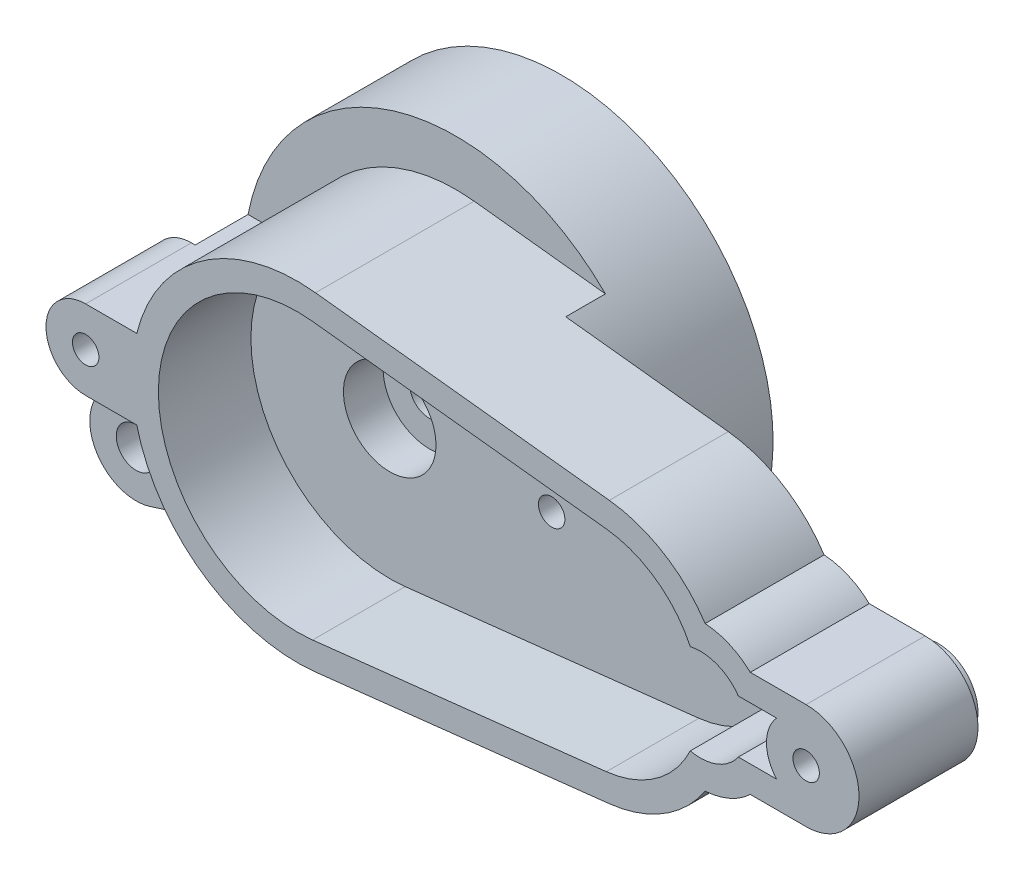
ISO-10303-21;
HEADER;
FILE_DESCRIPTION(('STEP AP214'),'2;1');
FILE_NAME('part.step','',(''),(''),'','','');
FILE_SCHEMA(('AUTOMOTIVE_DESIGN { 1 0 10303 214 1 1 1 1 }'));
ENDSEC;
DATA;
#1=APPLICATION_CONTEXT('core data for automotive mechanical design processes');
#2=APPLICATION_PROTOCOL_DEFINITION('international standard','automotive_design',2000,#1);
#3=PRODUCT_CONTEXT('',#1,'mechanical');
#4=PRODUCT('Part','Part','',(#3));
#5=PRODUCT_RELATED_PRODUCT_CATEGORY('part','',(#4));
#6=PRODUCT_DEFINITION_FORMATION('','',#4);
#7=PRODUCT_DEFINITION_CONTEXT('part definition',#1,'design');
#8=PRODUCT_DEFINITION('design','',#6,#7);
#9=PRODUCT_DEFINITION_SHAPE('','',#8);
#10=(LENGTH_UNIT() NAMED_UNIT(*) SI_UNIT(.MILLI.,.METRE.));
#11=(NAMED_UNIT(*) PLANE_ANGLE_UNIT() SI_UNIT($,.RADIAN.));
#12=(NAMED_UNIT(*) SI_UNIT($,.STERADIAN.) SOLID_ANGLE_UNIT());
#13=UNCERTAINTY_MEASURE_WITH_UNIT(LENGTH_MEASURE(1.E-05),#10,'distance_accuracy_value','');
#14=(GEOMETRIC_REPRESENTATION_CONTEXT(3) GLOBAL_UNCERTAINTY_ASSIGNED_CONTEXT((#13)) GLOBAL_UNIT_ASSIGNED_CONTEXT((#10,
#11,#12)) REPRESENTATION_CONTEXT('',''));
#15=CARTESIAN_POINT('',(0.,0.,0.));
#16=DIRECTION('',(0.,0.,1.));
#17=DIRECTION('',(1.,0.,0.));
#18=AXIS2_PLACEMENT_3D('',#15,#16,#17);
#19=CARTESIAN_POINT('',(-30.5,0.,-8.99999999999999));
#20=DIRECTION('',(0.,0.,1.));
#21=DIRECTION('',(1.,0.,0.));
#22=AXIS2_PLACEMENT_3D('',#19,#20,#21);
#23=CYLINDRICAL_SURFACE('',#22,12.5);
#24=CARTESIAN_POINT('',(-30.5,0.,-12.));
#25=DIRECTION('',(0.,0.,-1.));
#26=DIRECTION('',(-1.,0.,0.));
#27=AXIS2_PLACEMENT_3D('',#24,#25,#26);
#28=CIRCLE('',#27,12.5);
#29=CARTESIAN_POINT('',(-42.6346610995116,3.,-12.));
#30=VERTEX_POINT('',#29);
#31=CARTESIAN_POINT('',(-29.1111111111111,12.4225998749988,-12.));
#32=VERTEX_POINT('',#31);
#33=EDGE_CURVE('E444',#30,#32,#28,.T.);
#34=ORIENTED_EDGE('',*,*,#33,.F.);
#35=DIRECTION('',(0.,0.,1.));
#36=VECTOR('',#35,1.);
#37=CARTESIAN_POINT('',(-42.6346610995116,3.,-8.));
#38=LINE('',#37,#36);
#39=CARTESIAN_POINT('',(-42.6346610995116,3.,0.));
#40=VERTEX_POINT('',#39);
#41=EDGE_CURVE('E371',#30,#40,#38,.T.);
#42=ORIENTED_EDGE('',*,*,#41,.T.);
#43=CARTESIAN_POINT('',(-30.5,0.,0.));
#44=DIRECTION('',(0.,0.,1.));
#45=DIRECTION('',(1.,0.,0.));
#46=AXIS2_PLACEMENT_3D('',#43,#44,#45);
#47=CIRCLE('',#46,12.5);
#48=CARTESIAN_POINT('',(-29.1111111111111,12.4225998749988,0.));
#49=VERTEX_POINT('',#48);
#50=EDGE_CURVE('E587',#49,#40,#47,.T.);
#51=ORIENTED_EDGE('',*,*,#50,.F.);
#52=DIRECTION('',(0.,0.,1.));
#53=VECTOR('',#52,1.);
#54=CARTESIAN_POINT('',(-29.1111111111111,12.4225998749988,-8.99999999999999));
#55=LINE('',#54,#53);
#56=EDGE_CURVE('E641',#32,#49,#55,.T.);
#57=ORIENTED_EDGE('',*,*,#56,.F.);
#58=EDGE_LOOP('',(#34,#42,#51,#57));
#59=FACE_BOUND('',#58,.T.);
#60=ADVANCED_FACE('F30',(#59),#23,.T.);
#61=DIRECTION('',(0.,0.,1.));
#62=VECTOR('',#61,1.);
#63=CARTESIAN_POINT('',(-42.6346610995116,-3.,-8.));
#64=LINE('',#63,#62);
#65=CARTESIAN_POINT('',(-42.6346610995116,-3.,-12.));
#66=VERTEX_POINT('',#65);
#67=CARTESIAN_POINT('',(-42.6346610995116,-3.,0.));
#68=VERTEX_POINT('',#67);
#69=EDGE_CURVE('E372',#66,#68,#64,.T.);
#70=ORIENTED_EDGE('',*,*,#69,.F.);
#71=CARTESIAN_POINT('',(-29.1111111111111,-12.4225998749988,-12.));
#72=VERTEX_POINT('',#71);
#73=EDGE_CURVE('E439',#72,#66,#28,.T.);
#74=ORIENTED_EDGE('',*,*,#73,.F.);
#75=DIRECTION('',(0.,0.,1.));
#76=VECTOR('',#75,1.);
#77=CARTESIAN_POINT('',(-29.1111111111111,-12.4225998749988,-8.99999999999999));
#78=LINE('',#77,#76);
#79=CARTESIAN_POINT('',(-29.1111111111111,-12.4225998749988,0.));
#80=VERTEX_POINT('',#79);
#81=EDGE_CURVE('E638',#72,#80,#78,.T.);
#82=ORIENTED_EDGE('',*,*,#81,.T.);
#83=EDGE_CURVE('E586',#68,#80,#47,.T.);
#84=ORIENTED_EDGE('',*,*,#83,.F.);
#85=EDGE_LOOP('',(#70,#74,#82,#84));
#86=FACE_BOUND('',#85,.T.);
#87=ADVANCED_FACE('F754',(#86),#23,.T.);
#88=CARTESIAN_POINT('',(-30.5,0.,-12.));
#89=DIRECTION('',(0.,0.,-1.));
#90=DIRECTION('',(-1.,0.,0.));
#91=AXIS2_PLACEMENT_3D('',#88,#89,#90);
#92=PLANE('',#91);
#93=DIRECTION('',(-1.,0.,0.));
#94=VECTOR('',#93,1.);
#95=CARTESIAN_POINT('',(-42.6346610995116,3.,-12.));
#96=LINE('',#95,#94);
#97=CARTESIAN_POINT('',(-46.2162336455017,3.00000000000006,-12.));
#98=VERTEX_POINT('',#97);
#99=EDGE_CURVE('E304',#30,#98,#96,.T.);
#100=ORIENTED_EDGE('',*,*,#99,.F.);
#101=ORIENTED_EDGE('',*,*,#33,.T.);
#102=DIRECTION('',(0.993807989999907,-0.111111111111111,0.));
#103=VECTOR('',#102,1.);
#104=CARTESIAN_POINT('',(-29.1111111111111,12.4225998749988,-12.));
#105=LINE('',#104,#103);
#106=CARTESIAN_POINT('',(-19.1854615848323,11.3128785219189,-12.));
#107=VERTEX_POINT('',#106);
#108=EDGE_CURVE('E453',#32,#107,#105,.T.);
#109=ORIENTED_EDGE('',*,*,#108,.T.);
#110=CARTESIAN_POINT('',(-30.5,0.,-12.));
#111=DIRECTION('',(0.,0.,-1.));
#112=DIRECTION('',(-1.,0.,0.));
#113=AXIS2_PLACEMENT_3D('',#110,#111,#112);
#114=CIRCLE('',#113,16.);
#115=EDGE_CURVE('E34',#98,#107,#114,.T.);
#116=ORIENTED_EDGE('',*,*,#115,.F.);
#117=EDGE_LOOP('',(#100,#101,#109,#116));
#118=FACE_BOUND('',#117,.T.);
#119=ADVANCED_FACE('F739',(#118),#92,.F.);
#120=DIRECTION('',(0.673962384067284,0.738765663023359,0.));
#121=VECTOR('',#120,1.);
#122=CARTESIAN_POINT('',(-39.9354733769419,-10.342719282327,-12.));
#123=LINE('',#122,#121);
#124=CARTESIAN_POINT('',(-41.2833981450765,-11.8202506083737,-12.));
#125=VERTEX_POINT('',#124);
#126=CARTESIAN_POINT('',(-39.9354733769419,-10.342719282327,-12.));
#127=VERTEX_POINT('',#126);
#128=EDGE_CURVE('E341',#125,#127,#123,.T.);
#129=ORIENTED_EDGE('',*,*,#128,.F.);
#130=CARTESIAN_POINT('',(-19.1854615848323,-11.3128785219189,-12.));
#131=VERTEX_POINT('',#130);
#132=EDGE_CURVE('E411',#131,#125,#114,.T.);
#133=ORIENTED_EDGE('',*,*,#132,.F.);
#134=DIRECTION('',(-0.993807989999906,-0.111111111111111,0.));
#135=VECTOR('',#134,1.);
#136=CARTESIAN_POINT('',(-19.1854615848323,-11.3128785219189,-12.));
#137=LINE('',#136,#135);
#138=EDGE_CURVE('E436',#131,#72,#137,.T.);
#139=ORIENTED_EDGE('',*,*,#138,.T.);
#140=ORIENTED_EDGE('',*,*,#73,.T.);
#141=DIRECTION('',(1.,0.,0.));
#142=VECTOR('',#141,1.);
#143=CARTESIAN_POINT('',(-44.1747943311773,-3.,-12.));
#144=LINE('',#143,#142);
#145=CARTESIAN_POINT('',(-44.1747943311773,-3.,-12.));
#146=VERTEX_POINT('',#145);
#147=EDGE_CURVE('E334',#146,#66,#144,.T.);
#148=ORIENTED_EDGE('',*,*,#147,.F.);
#149=CARTESIAN_POINT('',(-30.5,0.,-12.));
#150=DIRECTION('',(0.,0.,-1.));
#151=DIRECTION('',(-1.,0.,0.));
#152=AXIS2_PLACEMENT_3D('',#149,#150,#151);
#153=CIRCLE('',#152,14.);
#154=EDGE_CURVE('E338',#127,#146,#153,.T.);
#155=ORIENTED_EDGE('',*,*,#154,.F.);
#156=EDGE_LOOP('',(#129,#133,#139,#140,#148,#155));
#157=FACE_BOUND('',#156,.T.);
#158=ADVANCED_FACE('F717',(#157),#92,.F.);
#159=CARTESIAN_POINT('',(-30.5,0.,-8.));
#160=DIRECTION('',(0.,0.,1.));
#161=DIRECTION('',(1.,0.,0.));
#162=AXIS2_PLACEMENT_3D('',#159,#160,#161);
#163=PLANE('',#162);
#164=CARTESIAN_POINT('',(-30.5,0.,-8.));
#165=DIRECTION('',(0.,0.,1.));
#166=DIRECTION('',(1.,0.,0.));
#167=AXIS2_PLACEMENT_3D('',#164,#165,#166);
#168=CIRCLE('',#167,16.);
#169=CARTESIAN_POINT('',(-46.2162336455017,3.00000000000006,-7.99999999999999));
#170=VERTEX_POINT('',#169);
#171=CARTESIAN_POINT('',(-41.2833981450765,-11.8202506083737,-7.99999999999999));
#172=VERTEX_POINT('',#171);
#173=EDGE_CURVE('E337',#170,#172,#168,.T.);
#174=ORIENTED_EDGE('',*,*,#173,.T.);
#175=DIRECTION('',(0.953051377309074,0.302808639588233,0.));
#176=VECTOR('',#175,1.);
#177=CARTESIAN_POINT('',(-41.2833981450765,-11.8202506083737,-7.99999999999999));
#178=LINE('',#177,#176);
#179=CARTESIAN_POINT('',(-47.6267032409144,-13.8356798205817,-7.99999999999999));
#180=VERTEX_POINT('',#179);
#181=EDGE_CURVE('E311',#180,#172,#178,.T.);
#182=ORIENTED_EDGE('',*,*,#181,.F.);
#183=CARTESIAN_POINT('',(-48.6865334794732,-10.5,-7.99999999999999));
#184=DIRECTION('',(0.,0.,1.));
#185=DIRECTION('',(1.,0.,0.));
#186=AXIS2_PLACEMENT_3D('',#183,#184,#185);
#187=CIRCLE('',#186,3.5);
#188=CARTESIAN_POINT('',(-51.2516877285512,-8.11882724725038,-7.99999999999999));
#189=VERTEX_POINT('',#188);
#190=EDGE_CURVE('E296',#189,#180,#187,.T.);
#191=ORIENTED_EDGE('',*,*,#190,.F.);
#192=DIRECTION('',(-0.680335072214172,-0.732901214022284,0.));
#193=VECTOR('',#192,1.);
#194=CARTESIAN_POINT('',(-46.5,-2.99999999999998,-7.99999999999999));
#195=LINE('',#194,#193);
#196=CARTESIAN_POINT('',(-46.5,-2.99999999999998,-7.99999999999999));
#197=VERTEX_POINT('',#196);
#198=EDGE_CURVE('E286',#197,#189,#195,.T.);
#199=ORIENTED_EDGE('',*,*,#198,.F.);
#200=CARTESIAN_POINT('',(-46.5,0.,-8.));
#201=DIRECTION('',(0.,0.,1.));
#202=DIRECTION('',(1.,0.,0.));
#203=AXIS2_PLACEMENT_3D('',#200,#201,#202);
#204=CIRCLE('',#203,3.);
#205=CARTESIAN_POINT('',(-46.5,3.00000000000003,-8.));
#206=VERTEX_POINT('',#205);
#207=EDGE_CURVE('E369',#206,#197,#204,.T.);
#208=ORIENTED_EDGE('',*,*,#207,.F.);
#209=DIRECTION('',(-1.,0.,0.));
#210=VECTOR('',#209,1.);
#211=CARTESIAN_POINT('',(-42.6346610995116,3.,-8.));
#212=LINE('',#211,#210);
#213=EDGE_CURVE('E367',#170,#206,#212,.T.);
#214=ORIENTED_EDGE('',*,*,#213,.F.);
#215=EDGE_LOOP('',(#174,#182,#191,#199,#208,#214));
#216=FACE_BOUND('',#215,.T.);
#217=CARTESIAN_POINT('',(-48.6865334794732,-10.5,-7.99999999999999));
#218=DIRECTION('',(0.,0.,1.));
#219=DIRECTION('',(1.,0.,0.));
#220=AXIS2_PLACEMENT_3D('',#217,#218,#219);
#221=CIRCLE('',#220,1.5);
#222=CARTESIAN_POINT('',(-50.1865334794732,-10.5,-7.99999999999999));
#223=VERTEX_POINT('',#222);
#224=EDGE_CURVE('E1017',#223,#223,#221,.T.);
#225=ORIENTED_EDGE('',*,*,#224,.T.);
#226=EDGE_LOOP('',(#225));
#227=FACE_BOUND('',#226,.T.);
#228=ADVANCED_FACE('F308',(#216,#227),#163,.F.);
#229=CARTESIAN_POINT('',(8.,0.,-8.99999999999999));
#230=DIRECTION('',(0.,0.,1.));
#231=DIRECTION('',(1.,0.,0.));
#232=AXIS2_PLACEMENT_3D('',#229,#230,#231);
#233=PLANE('',#232);
#234=CARTESIAN_POINT('',(-18.25,0.,-8.99999999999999));
#235=DIRECTION('',(0.,0.,1.));
#236=DIRECTION('',(1.,0.,0.));
#237=AXIS2_PLACEMENT_3D('',#234,#235,#236);
#238=CIRCLE('',#237,2.5);
#239=CARTESIAN_POINT('',(-16.6301020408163,-1.90418764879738,-8.99999999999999));
#240=VERTEX_POINT('',#239);
#241=CARTESIAN_POINT('',(-16.6301020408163,1.90418764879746,-8.99999999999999));
#242=VERTEX_POINT('',#241);
#243=EDGE_CURVE('E655',#240,#242,#238,.F.);
#244=ORIENTED_EDGE('',*,*,#243,.F.);
#245=CARTESIAN_POINT('',(-30.5,0.,-8.99999999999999));
#246=DIRECTION('',(0.,0.,-1.));
#247=DIRECTION('',(-1.,0.,0.));
#248=AXIS2_PLACEMENT_3D('',#245,#246,#247);
#249=CIRCLE('',#248,14.);
#250=CARTESIAN_POINT('',(-20.1305425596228,-9.40608060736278,-8.99999999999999));
#251=VERTEX_POINT('',#250);
#252=EDGE_CURVE('E410',#240,#251,#249,.T.);
#253=ORIENTED_EDGE('',*,*,#252,.T.);
#254=DIRECTION('',(-0.993807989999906,-0.111111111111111,0.));
#255=VECTOR('',#254,1.);
#256=CARTESIAN_POINT('',(-19.4076838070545,-9.32526254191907,-8.99999999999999));
#257=LINE('',#256,#255);
#258=CARTESIAN_POINT('',(-29.3333333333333,-10.434983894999,-8.99999999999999));
#259=VERTEX_POINT('',#258);
#260=EDGE_CURVE('E419',#251,#259,#257,.T.);
#261=ORIENTED_EDGE('',*,*,#260,.T.);
#262=CARTESIAN_POINT('',(-30.5,0.,-8.99999999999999));
#263=DIRECTION('',(0.,0.,-1.));
#264=DIRECTION('',(-1.,0.,0.));
#265=AXIS2_PLACEMENT_3D('',#262,#263,#264);
#266=CIRCLE('',#265,10.5);
#267=CARTESIAN_POINT('',(-29.3333333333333,10.4349838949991,-8.99999999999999));
#268=VERTEX_POINT('',#267);
#269=EDGE_CURVE('E421',#259,#268,#266,.T.);
#270=ORIENTED_EDGE('',*,*,#269,.T.);
#271=DIRECTION('',(0.993807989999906,-0.111111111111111,0.));
#272=VECTOR('',#271,1.);
#273=CARTESIAN_POINT('',(-29.3333333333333,10.4349838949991,-8.99999999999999));
#274=LINE('',#273,#272);
#275=CARTESIAN_POINT('',(-20.1305425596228,9.40608060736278,-8.99999999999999));
#276=VERTEX_POINT('',#275);
#277=EDGE_CURVE('E423',#268,#276,#274,.T.);
#278=ORIENTED_EDGE('',*,*,#277,.T.);
#279=EDGE_CURVE('E417',#276,#242,#249,.T.);
#280=ORIENTED_EDGE('',*,*,#279,.T.);
#281=EDGE_LOOP('',(#244,#253,#261,#270,#278,#280));
#282=FACE_BOUND('',#281,.T.);
#283=CARTESIAN_POINT('',(-30.5,0.,-8.99999999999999));
#284=DIRECTION('',(0.,0.,1.));
#285=DIRECTION('',(1.,0.,0.));
#286=AXIS2_PLACEMENT_3D('',#283,#284,#285);
#287=CIRCLE('',#286,5.);
#288=CARTESIAN_POINT('',(-25.5,0.,-8.99999999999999));
#289=VERTEX_POINT('',#288);
#290=EDGE_CURVE('E11',#289,#289,#287,.F.);
#291=ORIENTED_EDGE('',*,*,#290,.F.);
#292=EDGE_LOOP('',(#291));
#293=FACE_BOUND('',#292,.T.);
#294=ADVANCED_FACE('F785',(#282,#293),#233,.F.);
#295=CARTESIAN_POINT('',(-30.5,0.,-12.));
#296=DIRECTION('',(0.,0.,1.));
#297=DIRECTION('',(1.,0.,0.));
#298=AXIS2_PLACEMENT_3D('',#295,#296,#297);
#299=CYLINDRICAL_SURFACE('',#298,14.);
#300=CARTESIAN_POINT('',(-30.5,0.,-20.));
#301=DIRECTION('',(0.,0.,-1.));
#302=DIRECTION('',(-1.,0.,0.));
#303=AXIS2_PLACEMENT_3D('',#300,#301,#302);
#304=CIRCLE('',#303,14.);
#305=CARTESIAN_POINT('',(-44.5,0.,-20.));
#306=VERTEX_POINT('',#305);
#307=EDGE_CURVE('E405',#306,#306,#304,.T.);
#308=ORIENTED_EDGE('',*,*,#307,.T.);
#309=EDGE_LOOP('',(#308));
#310=FACE_BOUND('',#309,.T.);
#311=DIRECTION('',(0.,0.,1.));
#312=VECTOR('',#311,1.);
#313=CARTESIAN_POINT('',(-20.1305425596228,9.40608060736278,-12.));
#314=LINE('',#313,#312);
#315=CARTESIAN_POINT('',(-20.1305425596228,9.40608060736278,-14.));
#316=VERTEX_POINT('',#315);
#317=EDGE_CURVE('E425',#316,#276,#314,.T.);
#318=ORIENTED_EDGE('',*,*,#317,.F.);
#319=CARTESIAN_POINT('',(-30.5,0.,-14.));
#320=DIRECTION('',(0.,0.,-1.));
#321=DIRECTION('',(-1.,0.,0.));
#322=AXIS2_PLACEMENT_3D('',#319,#320,#321);
#323=CIRCLE('',#322,14.);
#324=CARTESIAN_POINT('',(-20.1305425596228,-9.40608060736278,-14.));
#325=VERTEX_POINT('',#324);
#326=EDGE_CURVE('E393',#325,#316,#323,.T.);
#327=ORIENTED_EDGE('',*,*,#326,.F.);
#328=DIRECTION('',(0.,0.,1.));
#329=VECTOR('',#328,1.);
#330=CARTESIAN_POINT('',(-20.1305425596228,-9.40608060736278,-12.));
#331=LINE('',#330,#329);
#332=EDGE_CURVE('E432',#325,#251,#331,.T.);
#333=ORIENTED_EDGE('',*,*,#332,.T.);
#334=ORIENTED_EDGE('',*,*,#252,.F.);
#335=DIRECTION('',(0.,0.,1.));
#336=VECTOR('',#335,1.);
#337=CARTESIAN_POINT('',(-16.6301020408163,-1.90418764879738,-9.99999999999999));
#338=LINE('',#337,#336);
#339=CARTESIAN_POINT('',(-16.6301020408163,-1.90418764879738,-11.));
#340=VERTEX_POINT('',#339);
#341=EDGE_CURVE('E459',#340,#240,#338,.T.);
#342=ORIENTED_EDGE('',*,*,#341,.F.);
#343=CARTESIAN_POINT('',(-30.5,0.,-11.));
#344=DIRECTION('',(0.,0.,-1.));
#345=DIRECTION('',(-1.,0.,0.));
#346=AXIS2_PLACEMENT_3D('',#343,#344,#345);
#347=CIRCLE('',#346,14.);
#348=CARTESIAN_POINT('',(-16.6301020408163,1.90418764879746,-11.));
#349=VERTEX_POINT('',#348);
#350=EDGE_CURVE('E40',#340,#349,#347,.F.);
#351=ORIENTED_EDGE('',*,*,#350,.T.);
#352=DIRECTION('',(0.,0.,1.));
#353=VECTOR('',#352,1.);
#354=CARTESIAN_POINT('',(-16.6301020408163,1.90418764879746,-9.99999999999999));
#355=LINE('',#354,#353);
#356=EDGE_CURVE('E449',#242,#349,#355,.F.);
#357=ORIENTED_EDGE('',*,*,#356,.F.);
#358=ORIENTED_EDGE('',*,*,#279,.F.);
#359=EDGE_LOOP('',(#318,#327,#333,#334,#342,#351,#357,#358));
#360=FACE_BOUND('',#359,.T.);
#361=ADVANCED_FACE('F787',(#310,#360),#299,.F.);
#362=CARTESIAN_POINT('',(-8.,0.,-8.99999999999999));
#363=DIRECTION('',(0.,0.,1.));
#364=DIRECTION('',(1.,0.,0.));
#365=AXIS2_PLACEMENT_3D('',#362,#363,#364);
#366=CIRCLE('',#365,2.5);
#367=CARTESIAN_POINT('',(-5.5,0.,-8.99999999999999));
#368=VERTEX_POINT('',#367);
#369=EDGE_CURVE('E652',#368,#368,#366,.F.);
#370=ORIENTED_EDGE('',*,*,#369,.F.);
#371=EDGE_LOOP('',(#370));
#372=FACE_BOUND('',#371,.T.);
#373=CARTESIAN_POINT('',(0.,0.,-8.99999999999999));
#374=DIRECTION('',(0.,0.,1.));
#375=DIRECTION('',(1.,0.,0.));
#376=AXIS2_PLACEMENT_3D('',#373,#374,#375);
#377=CIRCLE('',#376,1.5);
#378=CARTESIAN_POINT('',(1.5,0.,-8.99999999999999));
#379=VERTEX_POINT('',#378);
#380=EDGE_CURVE('E481',#379,#379,#377,.T.);
#381=ORIENTED_EDGE('',*,*,#380,.T.);
#382=EDGE_LOOP('',(#381));
#383=FACE_BOUND('',#382,.T.);
#384=CARTESIAN_POINT('',(8.,0.,-8.99999999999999));
#385=DIRECTION('',(0.,0.,1.));
#386=DIRECTION('',(1.,0.,0.));
#387=AXIS2_PLACEMENT_3D('',#384,#385,#386);
#388=CIRCLE('',#387,3.);
#389=CARTESIAN_POINT('',(11.,0.,-8.99999999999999));
#390=VERTEX_POINT('',#389);
#391=EDGE_CURVE('E501',#390,#390,#388,.T.);
#392=ORIENTED_EDGE('',*,*,#391,.T.);
#393=EDGE_LOOP('',(#392));
#394=FACE_BOUND('',#393,.T.);
#395=CARTESIAN_POINT('',(-30.5,0.,-8.99999999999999));
#396=DIRECTION('',(0.,0.,-1.));
#397=DIRECTION('',(-1.,0.,0.));
#398=AXIS2_PLACEMENT_3D('',#395,#396,#397);
#399=CIRCLE('',#398,16.);
#400=CARTESIAN_POINT('',(-19.1854615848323,11.3128785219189,-8.99999999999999));
#401=VERTEX_POINT('',#400);
#402=CARTESIAN_POINT('',(-19.1854615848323,-11.3128785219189,-8.99999999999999));
#403=VERTEX_POINT('',#402);
#404=EDGE_CURVE('E433',#401,#403,#399,.T.);
#405=ORIENTED_EDGE('',*,*,#404,.F.);
#406=DIRECTION('',(-0.993807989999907,0.111111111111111,0.));
#407=VECTOR('',#406,1.);
#408=CARTESIAN_POINT('',(-6.88888888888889,9.93807989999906,-8.99999999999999));
#409=LINE('',#408,#407);
#410=CARTESIAN_POINT('',(-6.88888888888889,9.93807989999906,-8.99999999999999));
#411=VERTEX_POINT('',#410);
#412=EDGE_CURVE('E614',#411,#401,#409,.T.);
#413=ORIENTED_EDGE('',*,*,#412,.F.);
#414=CARTESIAN_POINT('',(-8.,0.,-8.99999999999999));
#415=DIRECTION('',(0.,0.,1.));
#416=DIRECTION('',(-1.,0.,0.));
#417=AXIS2_PLACEMENT_3D('',#414,#415,#416);
#418=CIRCLE('',#417,10.);
#419=CARTESIAN_POINT('',(0.359374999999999,5.48824649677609,-8.99999999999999));
#420=VERTEX_POINT('',#419);
#421=EDGE_CURVE('E611',#420,#411,#418,.T.);
#422=ORIENTED_EDGE('',*,*,#421,.F.);
#423=CARTESIAN_POINT('',(0.,0.,-8.99999999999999));
#424=DIRECTION('',(0.,0.,1.));
#425=DIRECTION('',(1.,0.,0.));
#426=AXIS2_PLACEMENT_3D('',#423,#424,#425);
#427=CIRCLE('',#426,5.5);
#428=CARTESIAN_POINT('',(3.77491721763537,4.,-8.99999999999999));
#429=VERTEX_POINT('',#428);
#430=EDGE_CURVE('E608',#429,#420,#427,.T.);
#431=ORIENTED_EDGE('',*,*,#430,.F.);
#432=DIRECTION('',(-1.,0.,0.));
#433=VECTOR('',#432,1.);
#434=CARTESIAN_POINT('',(8.,4.,-8.99999999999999));
#435=LINE('',#434,#433);
#436=CARTESIAN_POINT('',(8.,4.,-8.99999999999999));
#437=VERTEX_POINT('',#436);
#438=EDGE_CURVE('E605',#437,#429,#435,.T.);
#439=ORIENTED_EDGE('',*,*,#438,.F.);
#440=CARTESIAN_POINT('',(8.,0.,-8.99999999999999));
#441=DIRECTION('',(0.,0.,1.));
#442=DIRECTION('',(1.,0.,0.));
#443=AXIS2_PLACEMENT_3D('',#440,#441,#442);
#444=CIRCLE('',#443,4.);
#445=CARTESIAN_POINT('',(8.00000000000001,-3.99999999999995,-8.99999999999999));
#446=VERTEX_POINT('',#445);
#447=EDGE_CURVE('E602',#446,#437,#444,.T.);
#448=ORIENTED_EDGE('',*,*,#447,.F.);
#449=DIRECTION('',(1.,0.,0.));
#450=VECTOR('',#449,1.);
#451=CARTESIAN_POINT('',(8.00000000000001,-3.99999999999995,-8.99999999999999));
#452=LINE('',#451,#450);
#453=CARTESIAN_POINT('',(3.77491721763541,-3.99999999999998,-8.99999999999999));
#454=VERTEX_POINT('',#453);
#455=EDGE_CURVE('E625',#454,#446,#452,.T.);
#456=ORIENTED_EDGE('',*,*,#455,.F.);
#457=CARTESIAN_POINT('',(0.,0.,-8.99999999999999));
#458=DIRECTION('',(0.,0.,1.));
#459=DIRECTION('',(1.,0.,0.));
#460=AXIS2_PLACEMENT_3D('',#457,#458,#459);
#461=CIRCLE('',#460,5.5);
#462=CARTESIAN_POINT('',(0.359375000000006,-5.48824649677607,-8.99999999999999));
#463=VERTEX_POINT('',#462);
#464=EDGE_CURVE('E622',#463,#454,#461,.T.);
#465=ORIENTED_EDGE('',*,*,#464,.F.);
#466=CARTESIAN_POINT('',(-8.,0.,-8.99999999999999));
#467=DIRECTION('',(0.,0.,1.));
#468=DIRECTION('',(-1.,0.,0.));
#469=AXIS2_PLACEMENT_3D('',#466,#467,#468);
#470=CIRCLE('',#469,10.);
#471=CARTESIAN_POINT('',(-6.88888888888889,-9.93807989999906,-8.99999999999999));
#472=VERTEX_POINT('',#471);
#473=EDGE_CURVE('E619',#472,#463,#470,.T.);
#474=ORIENTED_EDGE('',*,*,#473,.F.);
#475=DIRECTION('',(0.993807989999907,0.111111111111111,0.));
#476=VECTOR('',#475,1.);
#477=CARTESIAN_POINT('',(-29.1111111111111,-12.4225998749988,-8.99999999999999));
#478=LINE('',#477,#476);
#479=EDGE_CURVE('E617',#403,#472,#478,.T.);
#480=ORIENTED_EDGE('',*,*,#479,.F.);
#481=EDGE_LOOP('',(#405,#413,#422,#431,#439,#448,#456,#465,#474,#480));
#482=FACE_BOUND('',#481,.T.);
#483=ADVANCED_FACE('F679',(#372,#383,#394,#482),#233,.F.);
#484=CARTESIAN_POINT('',(8.,0.,-8.99999999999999));
#485=DIRECTION('',(0.,0.,1.));
#486=DIRECTION('',(1.,0.,0.));
#487=AXIS2_PLACEMENT_3D('',#484,#485,#486);
#488=CYLINDRICAL_SURFACE('',#487,4.);
#489=CARTESIAN_POINT('',(8.,0.,0.));
#490=DIRECTION('',(0.,0.,1.));
#491=DIRECTION('',(1.,0.,0.));
#492=AXIS2_PLACEMENT_3D('',#489,#490,#491);
#493=CIRCLE('',#492,4.);
#494=CARTESIAN_POINT('',(8.00000000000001,-3.99999999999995,0.));
#495=VERTEX_POINT('',#494);
#496=CARTESIAN_POINT('',(8.,4.,0.));
#497=VERTEX_POINT('',#496);
#498=EDGE_CURVE('E508',#495,#497,#493,.T.);
#499=ORIENTED_EDGE('',*,*,#498,.F.);
#500=DIRECTION('',(0.,0.,1.));
#501=VECTOR('',#500,1.);
#502=CARTESIAN_POINT('',(8.00000000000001,-3.99999999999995,-8.99999999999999));
#503=LINE('',#502,#501);
#504=EDGE_CURVE('E629',#446,#495,#503,.T.);
#505=ORIENTED_EDGE('',*,*,#504,.F.);
#506=ORIENTED_EDGE('',*,*,#447,.T.);
#507=DIRECTION('',(0.,0.,1.));
#508=VECTOR('',#507,1.);
#509=CARTESIAN_POINT('',(8.,4.,-8.99999999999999));
#510=LINE('',#509,#508);
#511=EDGE_CURVE('E628',#437,#497,#510,.T.);
#512=ORIENTED_EDGE('',*,*,#511,.T.);
#513=EDGE_LOOP('',(#499,#505,#506,#512));
#514=FACE_BOUND('',#513,.T.);
#515=ADVANCED_FACE('F32',(#514),#488,.T.);
#516=CARTESIAN_POINT('',(8.00000000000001,-3.99999999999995,-8.99999999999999));
#517=DIRECTION('',(0.,-1.,0.));
#518=DIRECTION('',(1.,0.,0.));
#519=AXIS2_PLACEMENT_3D('',#516,#517,#518);
#520=PLANE('',#519);
#521=DIRECTION('',(1.,0.,0.));
#522=VECTOR('',#521,1.);
#523=CARTESIAN_POINT('',(8.00000000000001,-3.99999999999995,0.));
#524=LINE('',#523,#522);
#525=CARTESIAN_POINT('',(3.77491721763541,-3.99999999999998,0.));
#526=VERTEX_POINT('',#525);
#527=EDGE_CURVE('E599',#526,#495,#524,.T.);
#528=ORIENTED_EDGE('',*,*,#527,.F.);
#529=DIRECTION('',(0.,0.,1.));
#530=VECTOR('',#529,1.);
#531=CARTESIAN_POINT('',(3.77491721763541,-3.99999999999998,-8.99999999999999));
#532=LINE('',#531,#530);
#533=EDGE_CURVE('E632',#454,#526,#532,.T.);
#534=ORIENTED_EDGE('',*,*,#533,.F.);
#535=ORIENTED_EDGE('',*,*,#455,.T.);
#536=ORIENTED_EDGE('',*,*,#504,.T.);
#537=EDGE_LOOP('',(#528,#534,#535,#536));
#538=FACE_BOUND('',#537,.T.);
#539=ADVANCED_FACE('F701',(#538),#520,.T.);
#540=CARTESIAN_POINT('',(0.,0.,-8.99999999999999));
#541=DIRECTION('',(0.,0.,1.));
#542=DIRECTION('',(1.,0.,0.));
#543=AXIS2_PLACEMENT_3D('',#540,#541,#542);
#544=CYLINDRICAL_SURFACE('',#543,5.5);
#545=CARTESIAN_POINT('',(0.,0.,0.));
#546=DIRECTION('',(0.,0.,1.));
#547=DIRECTION('',(1.,0.,0.));
#548=AXIS2_PLACEMENT_3D('',#545,#546,#547);
#549=CIRCLE('',#548,5.5);
#550=CARTESIAN_POINT('',(0.359375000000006,-5.48824649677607,0.));
#551=VERTEX_POINT('',#550);
#552=EDGE_CURVE('E596',#551,#526,#549,.T.);
#553=ORIENTED_EDGE('',*,*,#552,.F.);
#554=DIRECTION('',(0.,0.,1.));
#555=VECTOR('',#554,1.);
#556=CARTESIAN_POINT('',(0.359375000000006,-5.48824649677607,-8.99999999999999));
#557=LINE('',#556,#555);
#558=EDGE_CURVE('E634',#463,#551,#557,.T.);
#559=ORIENTED_EDGE('',*,*,#558,.F.);
#560=ORIENTED_EDGE('',*,*,#464,.T.);
#561=ORIENTED_EDGE('',*,*,#533,.T.);
#562=EDGE_LOOP('',(#553,#559,#560,#561));
#563=FACE_BOUND('',#562,.T.);
#564=ADVANCED_FACE('F744',(#563),#544,.T.);
#565=CARTESIAN_POINT('',(-8.,0.,-8.99999999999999));
#566=DIRECTION('',(0.,0.,1.));
#567=DIRECTION('',(1.,0.,0.));
#568=AXIS2_PLACEMENT_3D('',#565,#566,#567);
#569=CYLINDRICAL_SURFACE('',#568,10.);
#570=CARTESIAN_POINT('',(-8.,0.,0.));
#571=DIRECTION('',(0.,0.,1.));
#572=DIRECTION('',(-1.,0.,0.));
#573=AXIS2_PLACEMENT_3D('',#570,#571,#572);
#574=CIRCLE('',#573,10.);
#575=CARTESIAN_POINT('',(-6.88888888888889,-9.93807989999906,0.));
#576=VERTEX_POINT('',#575);
#577=EDGE_CURVE('E593',#576,#551,#574,.T.);
#578=ORIENTED_EDGE('',*,*,#577,.F.);
#579=DIRECTION('',(0.,0.,1.));
#580=VECTOR('',#579,1.);
#581=CARTESIAN_POINT('',(-6.88888888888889,-9.93807989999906,-8.99999999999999));
#582=LINE('',#581,#580);
#583=EDGE_CURVE('E636',#472,#576,#582,.T.);
#584=ORIENTED_EDGE('',*,*,#583,.F.);
#585=ORIENTED_EDGE('',*,*,#473,.T.);
#586=ORIENTED_EDGE('',*,*,#558,.T.);
#587=EDGE_LOOP('',(#578,#584,#585,#586));
#588=FACE_BOUND('',#587,.T.);
#589=ADVANCED_FACE('F707',(#588),#569,.T.);
#590=CARTESIAN_POINT('',(-29.1111111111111,-12.4225998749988,-8.99999999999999));
#591=DIRECTION('',(0.111111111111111,-0.993807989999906,0.));
#592=DIRECTION('',(0.993807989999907,0.111111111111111,0.));
#593=AXIS2_PLACEMENT_3D('',#590,#591,#592);
#594=PLANE('',#593);
#595=DIRECTION('',(0.993807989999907,0.111111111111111,0.));
#596=VECTOR('',#595,1.);
#597=CARTESIAN_POINT('',(-29.1111111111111,-12.4225998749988,0.));
#598=LINE('',#597,#596);
#599=EDGE_CURVE('E590',#80,#576,#598,.T.);
#600=ORIENTED_EDGE('',*,*,#599,.F.);
#601=ORIENTED_EDGE('',*,*,#81,.F.);
#602=ORIENTED_EDGE('',*,*,#138,.F.);
#603=DIRECTION('',(0.,0.,1.));
#604=VECTOR('',#603,1.);
#605=CARTESIAN_POINT('',(-19.1854615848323,-11.3128785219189,-12.));
#606=LINE('',#605,#604);
#607=EDGE_CURVE('E447',#131,#403,#606,.T.);
#608=ORIENTED_EDGE('',*,*,#607,.T.);
#609=ORIENTED_EDGE('',*,*,#479,.T.);
#610=ORIENTED_EDGE('',*,*,#583,.T.);
#611=EDGE_LOOP('',(#600,#601,#602,#608,#609,#610));
#612=FACE_BOUND('',#611,.T.);
#613=ADVANCED_FACE('F711',(#612),#594,.T.);
#614=CARTESIAN_POINT('',(-6.88888888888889,9.93807989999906,-8.99999999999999));
#615=DIRECTION('',(0.111111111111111,0.993807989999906,0.));
#616=DIRECTION('',(-0.993807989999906,0.111111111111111,0.));
#617=AXIS2_PLACEMENT_3D('',#614,#615,#616);
#618=PLANE('',#617);
#619=DIRECTION('',(-0.993807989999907,0.111111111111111,0.));
#620=VECTOR('',#619,1.);
#621=CARTESIAN_POINT('',(-6.88888888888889,9.93807989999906,0.));
#622=LINE('',#621,#620);
#623=CARTESIAN_POINT('',(-6.88888888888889,9.93807989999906,0.));
#624=VERTEX_POINT('',#623);
#625=EDGE_CURVE('E583',#624,#49,#622,.T.);
#626=ORIENTED_EDGE('',*,*,#625,.F.);
#627=DIRECTION('',(0.,0.,1.));
#628=VECTOR('',#627,1.);
#629=CARTESIAN_POINT('',(-6.88888888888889,9.93807989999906,-8.99999999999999));
#630=LINE('',#629,#628);
#631=EDGE_CURVE('E643',#411,#624,#630,.T.);
#632=ORIENTED_EDGE('',*,*,#631,.F.);
#633=ORIENTED_EDGE('',*,*,#412,.T.);
#634=DIRECTION('',(0.,0.,1.));
#635=VECTOR('',#634,1.);
#636=CARTESIAN_POINT('',(-19.1854615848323,11.3128785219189,-12.));
#637=LINE('',#636,#635);
#638=EDGE_CURVE('E450',#107,#401,#637,.T.);
#639=ORIENTED_EDGE('',*,*,#638,.F.);
#640=ORIENTED_EDGE('',*,*,#108,.F.);
#641=ORIENTED_EDGE('',*,*,#56,.T.);
#642=EDGE_LOOP('',(#626,#632,#633,#639,#640,#641));
#643=FACE_BOUND('',#642,.T.);
#644=ADVANCED_FACE('F683',(#643),#618,.T.);
#645=CARTESIAN_POINT('',(-8.,0.,-8.99999999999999));
#646=DIRECTION('',(0.,0.,1.));
#647=DIRECTION('',(1.,0.,0.));
#648=AXIS2_PLACEMENT_3D('',#645,#646,#647);
#649=CYLINDRICAL_SURFACE('',#648,10.);
#650=CARTESIAN_POINT('',(-8.,0.,0.));
#651=DIRECTION('',(0.,0.,1.));
#652=DIRECTION('',(-1.,0.,0.));
#653=AXIS2_PLACEMENT_3D('',#650,#651,#652);
#654=CIRCLE('',#653,10.);
#655=CARTESIAN_POINT('',(0.359374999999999,5.48824649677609,0.));
#656=VERTEX_POINT('',#655);
#657=EDGE_CURVE('E580',#656,#624,#654,.T.);
#658=ORIENTED_EDGE('',*,*,#657,.F.);
#659=DIRECTION('',(0.,0.,1.));
#660=VECTOR('',#659,1.);
#661=CARTESIAN_POINT('',(0.359374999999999,5.48824649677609,-8.99999999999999));
#662=LINE('',#661,#660);
#663=EDGE_CURVE('E645',#420,#656,#662,.T.);
#664=ORIENTED_EDGE('',*,*,#663,.F.);
#665=ORIENTED_EDGE('',*,*,#421,.T.);
#666=ORIENTED_EDGE('',*,*,#631,.T.);
#667=EDGE_LOOP('',(#658,#664,#665,#666));
#668=FACE_BOUND('',#667,.T.);
#669=ADVANCED_FACE('F686',(#668),#649,.T.);
#670=CARTESIAN_POINT('',(0.,0.,-8.99999999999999));
#671=DIRECTION('',(0.,0.,1.));
#672=DIRECTION('',(1.,0.,0.));
#673=AXIS2_PLACEMENT_3D('',#670,#671,#672);
#674=CYLINDRICAL_SURFACE('',#673,5.5);
#675=CARTESIAN_POINT('',(0.,0.,0.));
#676=DIRECTION('',(0.,0.,1.));
#677=DIRECTION('',(1.,0.,0.));
#678=AXIS2_PLACEMENT_3D('',#675,#676,#677);
#679=CIRCLE('',#678,5.5);
#680=CARTESIAN_POINT('',(3.77491721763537,4.,0.));
#681=VERTEX_POINT('',#680);
#682=EDGE_CURVE('E577',#681,#656,#679,.T.);
#683=ORIENTED_EDGE('',*,*,#682,.F.);
#684=DIRECTION('',(0.,0.,1.));
#685=VECTOR('',#684,1.);
#686=CARTESIAN_POINT('',(3.77491721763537,4.,-8.99999999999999));
#687=LINE('',#686,#685);
#688=EDGE_CURVE('E647',#429,#681,#687,.T.);
#689=ORIENTED_EDGE('',*,*,#688,.F.);
#690=ORIENTED_EDGE('',*,*,#430,.T.);
#691=ORIENTED_EDGE('',*,*,#663,.T.);
#692=EDGE_LOOP('',(#683,#689,#690,#691));
#693=FACE_BOUND('',#692,.T.);
#694=ADVANCED_FACE('F691',(#693),#674,.T.);
#695=CARTESIAN_POINT('',(8.,4.,-8.99999999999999));
#696=DIRECTION('',(0.,1.,0.));
#697=DIRECTION('',(0.,0.,1.));
#698=AXIS2_PLACEMENT_3D('',#695,#696,#697);
#699=PLANE('',#698);
#700=DIRECTION('',(-1.,0.,0.));
#701=VECTOR('',#700,1.);
#702=CARTESIAN_POINT('',(8.,4.,0.));
#703=LINE('',#702,#701);
#704=EDGE_CURVE('E574',#497,#681,#703,.T.);
#705=ORIENTED_EDGE('',*,*,#704,.F.);
#706=ORIENTED_EDGE('',*,*,#511,.F.);
#707=ORIENTED_EDGE('',*,*,#438,.T.);
#708=ORIENTED_EDGE('',*,*,#688,.T.);
#709=EDGE_LOOP('',(#705,#706,#707,#708));
#710=FACE_BOUND('',#709,.T.);
#711=ADVANCED_FACE('F694',(#710),#699,.T.);
#712=CARTESIAN_POINT('',(8.,0.,0.));
#713=DIRECTION('',(0.,0.,1.));
#714=DIRECTION('',(1.,0.,0.));
#715=AXIS2_PLACEMENT_3D('',#712,#713,#714);
#716=PLANE('',#715);
#717=CARTESIAN_POINT('',(-46.5,0.,0.));
#718=DIRECTION('',(0.,0.,1.));
#719=DIRECTION('',(1.,0.,0.));
#720=AXIS2_PLACEMENT_3D('',#717,#718,#719);
#721=CIRCLE('',#720,0.999999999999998);
#722=CARTESIAN_POINT('',(-45.5,0.,0.));
#723=VERTEX_POINT('',#722);
#724=EDGE_CURVE('E349',#723,#723,#721,.T.);
#725=ORIENTED_EDGE('',*,*,#724,.F.);
#726=EDGE_LOOP('',(#725));
#727=FACE_BOUND('',#726,.T.);
#728=CARTESIAN_POINT('',(8.,0.,0.));
#729=DIRECTION('',(0.,0.,1.));
#730=DIRECTION('',(1.,0.,0.));
#731=AXIS2_PLACEMENT_3D('',#728,#729,#730);
#732=CIRCLE('',#731,1.);
#733=CARTESIAN_POINT('',(9.00000000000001,0.,0.));
#734=VERTEX_POINT('',#733);
#735=EDGE_CURVE('E484',#734,#734,#732,.T.);
#736=ORIENTED_EDGE('',*,*,#735,.F.);
#737=EDGE_LOOP('',(#736));
#738=FACE_BOUND('',#737,.T.);
#739=DIRECTION('',(-1.,0.,0.));
#740=VECTOR('',#739,1.);
#741=CARTESIAN_POINT('',(8.00000000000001,2.00000000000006,0.));
#742=LINE('',#741,#740);
#743=CARTESIAN_POINT('',(5.76393202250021,2.,0.));
#744=VERTEX_POINT('',#743);
#745=CARTESIAN_POINT('',(2.87228132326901,2.,0.));
#746=VERTEX_POINT('',#745);
#747=EDGE_CURVE('E504',#744,#746,#742,.T.);
#748=ORIENTED_EDGE('',*,*,#747,.F.);
#749=CARTESIAN_POINT('',(8.,0.,0.));
#750=DIRECTION('',(0.,0.,1.));
#751=DIRECTION('',(1.,0.,0.));
#752=AXIS2_PLACEMENT_3D('',#749,#750,#751);
#753=CIRCLE('',#752,3.);
#754=CARTESIAN_POINT('',(5.76393202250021,-1.99999999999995,0.));
#755=VERTEX_POINT('',#754);
#756=EDGE_CURVE('E490',#744,#755,#753,.T.);
#757=ORIENTED_EDGE('',*,*,#756,.T.);
#758=DIRECTION('',(1.,0.,0.));
#759=VECTOR('',#758,1.);
#760=CARTESIAN_POINT('',(7.99999999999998,-2.,0.));
#761=LINE('',#760,#759);
#762=CARTESIAN_POINT('',(2.87228132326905,-1.99999999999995,0.));
#763=VERTEX_POINT('',#762);
#764=EDGE_CURVE('E549',#763,#755,#761,.T.);
#765=ORIENTED_EDGE('',*,*,#764,.F.);
#766=CARTESIAN_POINT('',(0.,0.,0.));
#767=DIRECTION('',(0.,0.,1.));
#768=DIRECTION('',(1.,0.,0.));
#769=AXIS2_PLACEMENT_3D('',#766,#767,#768);
#770=CIRCLE('',#769,3.5);
#771=CARTESIAN_POINT('',(-0.765624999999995,-3.4152332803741,0.));
#772=VERTEX_POINT('',#771);
#773=EDGE_CURVE('E569',#772,#763,#770,.T.);
#774=ORIENTED_EDGE('',*,*,#773,.F.);
#775=CARTESIAN_POINT('',(-8.,0.,0.));
#776=DIRECTION('',(0.,0.,1.));
#777=DIRECTION('',(1.,0.,0.));
#778=AXIS2_PLACEMENT_3D('',#775,#776,#777);
#779=CIRCLE('',#778,8.);
#780=CARTESIAN_POINT('',(-7.11111111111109,-7.95046391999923,0.));
#781=VERTEX_POINT('',#780);
#782=EDGE_CURVE('E566',#781,#772,#779,.T.);
#783=ORIENTED_EDGE('',*,*,#782,.F.);
#784=DIRECTION('',(0.993807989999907,0.111111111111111,0.));
#785=VECTOR('',#784,1.);
#786=CARTESIAN_POINT('',(8.69135802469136,-6.18369415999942,0.));
#787=LINE('',#786,#785);
#788=CARTESIAN_POINT('',(-29.3333333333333,-10.434983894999,0.));
#789=VERTEX_POINT('',#788);
#790=EDGE_CURVE('E563',#789,#781,#787,.T.);
#791=ORIENTED_EDGE('',*,*,#790,.F.);
#792=CARTESIAN_POINT('',(-30.5,0.,0.));
#793=DIRECTION('',(0.,0.,1.));
#794=DIRECTION('',(1.,0.,0.));
#795=AXIS2_PLACEMENT_3D('',#792,#793,#794);
#796=CIRCLE('',#795,10.5);
#797=CARTESIAN_POINT('',(-29.3333333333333,10.4349838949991,0.));
#798=VERTEX_POINT('',#797);
#799=EDGE_CURVE('E560',#798,#789,#796,.T.);
#800=ORIENTED_EDGE('',*,*,#799,.F.);
#801=DIRECTION('',(-0.993807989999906,0.111111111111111,0.));
#802=VECTOR('',#801,1.);
#803=CARTESIAN_POINT('',(8.69135802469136,6.18369415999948,0.));
#804=LINE('',#803,#802);
#805=CARTESIAN_POINT('',(-7.11111111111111,7.95046391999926,0.));
#806=VERTEX_POINT('',#805);
#807=EDGE_CURVE('E557',#806,#798,#804,.T.);
#808=ORIENTED_EDGE('',*,*,#807,.F.);
#809=CARTESIAN_POINT('',(-8.,0.,0.));
#810=DIRECTION('',(0.,0.,1.));
#811=DIRECTION('',(1.,0.,0.));
#812=AXIS2_PLACEMENT_3D('',#809,#810,#811);
#813=CIRCLE('',#812,8.);
#814=CARTESIAN_POINT('',(-0.765624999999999,3.41523328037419,0.));
#815=VERTEX_POINT('',#814);
#816=EDGE_CURVE('E554',#815,#806,#813,.T.);
#817=ORIENTED_EDGE('',*,*,#816,.F.);
#818=CARTESIAN_POINT('',(0.,0.,0.));
#819=DIRECTION('',(0.,0.,1.));
#820=DIRECTION('',(1.,0.,0.));
#821=AXIS2_PLACEMENT_3D('',#818,#819,#820);
#822=CIRCLE('',#821,3.5);
#823=EDGE_CURVE('E551',#746,#815,#822,.T.);
#824=ORIENTED_EDGE('',*,*,#823,.F.);
#825=EDGE_LOOP('',(#748,#757,#765,#774,#783,#791,#800,#808,#817,#824));
#826=FACE_BOUND('',#825,.T.);
#827=ORIENTED_EDGE('',*,*,#498,.T.);
#828=ORIENTED_EDGE('',*,*,#704,.T.);
#829=ORIENTED_EDGE('',*,*,#682,.T.);
#830=ORIENTED_EDGE('',*,*,#657,.T.);
#831=ORIENTED_EDGE('',*,*,#625,.T.);
#832=ORIENTED_EDGE('',*,*,#50,.T.);
#833=DIRECTION('',(-1.,0.,0.));
#834=VECTOR('',#833,1.);
#835=CARTESIAN_POINT('',(-42.6346610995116,3.,0.));
#836=LINE('',#835,#834);
#837=CARTESIAN_POINT('',(-46.5,3.00000000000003,0.));
#838=VERTEX_POINT('',#837);
#839=EDGE_CURVE('E359',#40,#838,#836,.T.);
#840=ORIENTED_EDGE('',*,*,#839,.T.);
#841=CARTESIAN_POINT('',(-46.5,0.,0.));
#842=DIRECTION('',(0.,0.,1.));
#843=DIRECTION('',(1.,0.,0.));
#844=AXIS2_PLACEMENT_3D('',#841,#842,#843);
#845=CIRCLE('',#844,3.);
#846=CARTESIAN_POINT('',(-46.5,-2.99999999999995,0.));
#847=VERTEX_POINT('',#846);
#848=EDGE_CURVE('E362',#838,#847,#845,.T.);
#849=ORIENTED_EDGE('',*,*,#848,.T.);
#850=DIRECTION('',(1.,0.,0.));
#851=VECTOR('',#850,1.);
#852=CARTESIAN_POINT('',(-46.5,-2.99999999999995,0.));
#853=LINE('',#852,#851);
#854=EDGE_CURVE('E365',#847,#68,#853,.T.);
#855=ORIENTED_EDGE('',*,*,#854,.T.);
#856=ORIENTED_EDGE('',*,*,#83,.T.);
#857=ORIENTED_EDGE('',*,*,#599,.T.);
#858=ORIENTED_EDGE('',*,*,#577,.T.);
#859=ORIENTED_EDGE('',*,*,#552,.T.);
#860=ORIENTED_EDGE('',*,*,#527,.T.);
#861=EDGE_LOOP('',(#827,#828,#829,#830,#831,#832,#840,#849,#855,#856,#857,#858,#859,#860));
#862=FACE_BOUND('',#861,.T.);
#863=ADVANCED_FACE('F743',(#727,#738,#826,#862),#716,.T.);
#864=CARTESIAN_POINT('',(8.00000000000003,-1.99999999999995,-8.99999999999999));
#865=DIRECTION('',(0.,-1.,0.));
#866=DIRECTION('',(1.,0.,0.));
#867=AXIS2_PLACEMENT_3D('',#864,#865,#866);
#868=PLANE('',#867);
#869=ORIENTED_EDGE('',*,*,#764,.T.);
#870=DIRECTION('',(0.,0.,1.));
#871=VECTOR('',#870,1.);
#872=CARTESIAN_POINT('',(5.76393202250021,-1.99999999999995,-9.99999999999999));
#873=LINE('',#872,#871);
#874=CARTESIAN_POINT('',(5.76393202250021,-1.99999999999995,-6.99999999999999));
#875=VERTEX_POINT('',#874);
#876=EDGE_CURVE('E498',#755,#875,#873,.F.);
#877=ORIENTED_EDGE('',*,*,#876,.T.);
#878=DIRECTION('',(1.,0.,0.));
#879=VECTOR('',#878,1.);
#880=CARTESIAN_POINT('',(7.99999999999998,-2.,-6.99999999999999));
#881=LINE('',#880,#879);
#882=CARTESIAN_POINT('',(2.87228132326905,-1.99999999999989,-6.99999999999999));
#883=VERTEX_POINT('',#882);
#884=EDGE_CURVE('E510',#883,#875,#881,.T.);
#885=ORIENTED_EDGE('',*,*,#884,.F.);
#886=DIRECTION('',(0.,0.,1.));
#887=VECTOR('',#886,1.);
#888=CARTESIAN_POINT('',(2.87228132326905,-1.99999999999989,-6.99999999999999));
#889=LINE('',#888,#887);
#890=EDGE_CURVE('E505',#883,#763,#889,.T.);
#891=ORIENTED_EDGE('',*,*,#890,.T.);
#892=EDGE_LOOP('',(#869,#877,#885,#891));
#893=FACE_BOUND('',#892,.T.);
#894=ADVANCED_FACE('F770',(#893),#868,.F.);
#895=CARTESIAN_POINT('',(0.,0.,-8.99999999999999));
#896=DIRECTION('',(0.,0.,1.));
#897=DIRECTION('',(1.,0.,0.));
#898=AXIS2_PLACEMENT_3D('',#895,#896,#897);
#899=CYLINDRICAL_SURFACE('',#898,3.5);
#900=ORIENTED_EDGE('',*,*,#773,.T.);
#901=ORIENTED_EDGE('',*,*,#890,.F.);
#902=CARTESIAN_POINT('',(0.,0.,-6.99999999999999));
#903=DIRECTION('',(0.,0.,1.));
#904=DIRECTION('',(1.,0.,0.));
#905=AXIS2_PLACEMENT_3D('',#902,#903,#904);
#906=CIRCLE('',#905,3.5);
#907=CARTESIAN_POINT('',(-0.765624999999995,-3.4152332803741,-7.));
#908=VERTEX_POINT('',#907);
#909=EDGE_CURVE('E513',#908,#883,#906,.T.);
#910=ORIENTED_EDGE('',*,*,#909,.F.);
#911=DIRECTION('',(0.,0.,1.));
#912=VECTOR('',#911,1.);
#913=CARTESIAN_POINT('',(-0.765624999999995,-3.4152332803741,-7.));
#914=LINE('',#913,#912);
#915=EDGE_CURVE('E509',#908,#772,#914,.T.);
#916=ORIENTED_EDGE('',*,*,#915,.T.);
#917=EDGE_LOOP('',(#900,#901,#910,#916));
#918=FACE_BOUND('',#917,.T.);
#919=ADVANCED_FACE('F776',(#918),#899,.F.);
#920=CARTESIAN_POINT('',(-8.,0.,-8.99999999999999));
#921=DIRECTION('',(0.,0.,1.));
#922=DIRECTION('',(1.,0.,0.));
#923=AXIS2_PLACEMENT_3D('',#920,#921,#922);
#924=CYLINDRICAL_SURFACE('',#923,8.);
#925=ORIENTED_EDGE('',*,*,#782,.T.);
#926=ORIENTED_EDGE('',*,*,#915,.F.);
#927=CARTESIAN_POINT('',(-8.,0.,-6.99999999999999));
#928=DIRECTION('',(0.,0.,1.));
#929=DIRECTION('',(1.,0.,0.));
#930=AXIS2_PLACEMENT_3D('',#927,#928,#929);
#931=CIRCLE('',#930,8.);
#932=CARTESIAN_POINT('',(-7.11111111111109,-7.95046391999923,-7.));
#933=VERTEX_POINT('',#932);
#934=EDGE_CURVE('E518',#933,#908,#931,.T.);
#935=ORIENTED_EDGE('',*,*,#934,.F.);
#936=DIRECTION('',(0.,0.,1.));
#937=VECTOR('',#936,1.);
#938=CARTESIAN_POINT('',(-7.11111111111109,-7.95046391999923,-8.99999999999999));
#939=LINE('',#938,#937);
#940=EDGE_CURVE('E515',#933,#781,#939,.T.);
#941=ORIENTED_EDGE('',*,*,#940,.T.);
#942=EDGE_LOOP('',(#925,#926,#935,#941));
#943=FACE_BOUND('',#942,.T.);
#944=ADVANCED_FACE('F827',(#943),#924,.F.);
#945=CARTESIAN_POINT('',(-29.3333333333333,-10.434983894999,-8.99999999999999));
#946=DIRECTION('',(0.111111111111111,-0.993807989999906,0.));
#947=DIRECTION('',(0.993807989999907,0.111111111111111,0.));
#948=AXIS2_PLACEMENT_3D('',#945,#946,#947);
#949=PLANE('',#948);
#950=ORIENTED_EDGE('',*,*,#790,.T.);
#951=ORIENTED_EDGE('',*,*,#940,.F.);
#952=DIRECTION('',(0.993807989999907,0.111111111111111,0.));
#953=VECTOR('',#952,1.);
#954=CARTESIAN_POINT('',(8.69135802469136,-6.18369415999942,-7.));
#955=LINE('',#954,#953);
#956=CARTESIAN_POINT('',(-29.3333333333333,-10.434983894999,-6.99999999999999));
#957=VERTEX_POINT('',#956);
#958=EDGE_CURVE('E523',#957,#933,#955,.T.);
#959=ORIENTED_EDGE('',*,*,#958,.F.);
#960=DIRECTION('',(0.,0.,1.));
#961=VECTOR('',#960,1.);
#962=CARTESIAN_POINT('',(-29.3333333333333,-10.434983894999,-8.99999999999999));
#963=LINE('',#962,#961);
#964=EDGE_CURVE('E520',#957,#789,#963,.T.);
#965=ORIENTED_EDGE('',*,*,#964,.T.);
#966=EDGE_LOOP('',(#950,#951,#959,#965));
#967=FACE_BOUND('',#966,.T.);
#968=ADVANCED_FACE('F831',(#967),#949,.F.);
#969=CARTESIAN_POINT('',(-30.5,0.,-8.99999999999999));
#970=DIRECTION('',(0.,0.,1.));
#971=DIRECTION('',(1.,0.,0.));
#972=AXIS2_PLACEMENT_3D('',#969,#970,#971);
#973=CYLINDRICAL_SURFACE('',#972,10.5);
#974=ORIENTED_EDGE('',*,*,#799,.T.);
#975=ORIENTED_EDGE('',*,*,#964,.F.);
#976=CARTESIAN_POINT('',(-30.5,0.,-7.));
#977=DIRECTION('',(0.,0.,1.));
#978=DIRECTION('',(1.,0.,0.));
#979=AXIS2_PLACEMENT_3D('',#976,#977,#978);
#980=CIRCLE('',#979,10.5);
#981=CARTESIAN_POINT('',(-29.3333333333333,10.4349838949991,-6.99999999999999));
#982=VERTEX_POINT('',#981);
#983=EDGE_CURVE('E528',#982,#957,#980,.T.);
#984=ORIENTED_EDGE('',*,*,#983,.F.);
#985=DIRECTION('',(0.,0.,1.));
#986=VECTOR('',#985,1.);
#987=CARTESIAN_POINT('',(-29.3333333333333,10.4349838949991,-8.99999999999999));
#988=LINE('',#987,#986);
#989=EDGE_CURVE('E525',#982,#798,#988,.T.);
#990=ORIENTED_EDGE('',*,*,#989,.T.);
#991=EDGE_LOOP('',(#974,#975,#984,#990));
#992=FACE_BOUND('',#991,.T.);
#993=ADVANCED_FACE('F835',(#992),#973,.F.);
#994=CARTESIAN_POINT('',(-7.11111111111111,7.95046391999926,-8.99999999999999));
#995=DIRECTION('',(0.111111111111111,0.993807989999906,0.));
#996=DIRECTION('',(-0.993807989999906,0.111111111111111,0.));
#997=AXIS2_PLACEMENT_3D('',#994,#995,#996);
#998=PLANE('',#997);
#999=ORIENTED_EDGE('',*,*,#807,.T.);
#1000=ORIENTED_EDGE('',*,*,#989,.F.);
#1001=DIRECTION('',(-0.993807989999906,0.111111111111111,0.));
#1002=VECTOR('',#1001,1.);
#1003=CARTESIAN_POINT('',(8.69135802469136,6.18369415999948,-6.99999999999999));
#1004=LINE('',#1003,#1002);
#1005=CARTESIAN_POINT('',(-7.11111111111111,7.95046391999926,-6.99999999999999));
#1006=VERTEX_POINT('',#1005);
#1007=EDGE_CURVE('E533',#1006,#982,#1004,.T.);
#1008=ORIENTED_EDGE('',*,*,#1007,.F.);
#1009=DIRECTION('',(0.,0.,1.));
#1010=VECTOR('',#1009,1.);
#1011=CARTESIAN_POINT('',(-7.11111111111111,7.95046391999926,-8.99999999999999));
#1012=LINE('',#1011,#1010);
#1013=EDGE_CURVE('E530',#1006,#806,#1012,.T.);
#1014=ORIENTED_EDGE('',*,*,#1013,.T.);
#1015=EDGE_LOOP('',(#999,#1000,#1008,#1014));
#1016=FACE_BOUND('',#1015,.T.);
#1017=ADVANCED_FACE('F839',(#1016),#998,.F.);
#1018=CARTESIAN_POINT('',(-8.,0.,-8.99999999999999));
#1019=DIRECTION('',(0.,0.,1.));
#1020=DIRECTION('',(1.,0.,0.));
#1021=AXIS2_PLACEMENT_3D('',#1018,#1019,#1020);
#1022=CYLINDRICAL_SURFACE('',#1021,8.);
#1023=ORIENTED_EDGE('',*,*,#816,.T.);
#1024=ORIENTED_EDGE('',*,*,#1013,.F.);
#1025=CARTESIAN_POINT('',(-8.,0.,-6.99999999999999));
#1026=DIRECTION('',(0.,0.,1.));
#1027=DIRECTION('',(1.,0.,0.));
#1028=AXIS2_PLACEMENT_3D('',#1025,#1026,#1027);
#1029=CIRCLE('',#1028,8.);
#1030=CARTESIAN_POINT('',(-0.765624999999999,3.41523328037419,-6.99999999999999));
#1031=VERTEX_POINT('',#1030);
#1032=EDGE_CURVE('E538',#1031,#1006,#1029,.T.);
#1033=ORIENTED_EDGE('',*,*,#1032,.F.);
#1034=DIRECTION('',(0.,0.,1.));
#1035=VECTOR('',#1034,1.);
#1036=CARTESIAN_POINT('',(-0.765624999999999,3.41523328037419,-6.99999999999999));
#1037=LINE('',#1036,#1035);
#1038=EDGE_CURVE('E535',#1031,#815,#1037,.T.);
#1039=ORIENTED_EDGE('',*,*,#1038,.T.);
#1040=EDGE_LOOP('',(#1023,#1024,#1033,#1039));
#1041=FACE_BOUND('',#1040,.T.);
#1042=ADVANCED_FACE('F843',(#1041),#1022,.F.);
#1043=CARTESIAN_POINT('',(0.,0.,-8.99999999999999));
#1044=DIRECTION('',(0.,0.,1.));
#1045=DIRECTION('',(1.,0.,0.));
#1046=AXIS2_PLACEMENT_3D('',#1043,#1044,#1045);
#1047=CYLINDRICAL_SURFACE('',#1046,3.5);
#1048=ORIENTED_EDGE('',*,*,#823,.T.);
#1049=ORIENTED_EDGE('',*,*,#1038,.F.);
#1050=CARTESIAN_POINT('',(0.,0.,-6.99999999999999));
#1051=DIRECTION('',(0.,0.,1.));
#1052=DIRECTION('',(1.,0.,0.));
#1053=AXIS2_PLACEMENT_3D('',#1050,#1051,#1052);
#1054=CIRCLE('',#1053,3.5);
#1055=CARTESIAN_POINT('',(2.87228132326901,2.,-6.99999999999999));
#1056=VERTEX_POINT('',#1055);
#1057=EDGE_CURVE('E542',#1056,#1031,#1054,.T.);
#1058=ORIENTED_EDGE('',*,*,#1057,.F.);
#1059=DIRECTION('',(0.,0.,1.));
#1060=VECTOR('',#1059,1.);
#1061=CARTESIAN_POINT('',(2.87228132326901,2.,-6.99999999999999));
#1062=LINE('',#1061,#1060);
#1063=EDGE_CURVE('E512',#1056,#746,#1062,.T.);
#1064=ORIENTED_EDGE('',*,*,#1063,.T.);
#1065=EDGE_LOOP('',(#1048,#1049,#1058,#1064));
#1066=FACE_BOUND('',#1065,.T.);
#1067=ADVANCED_FACE('F847',(#1066),#1047,.F.);
#1068=CARTESIAN_POINT('',(8.00000000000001,2.00000000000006,-8.99999999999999));
#1069=DIRECTION('',(0.,1.,0.));
#1070=DIRECTION('',(0.,0.,1.));
#1071=AXIS2_PLACEMENT_3D('',#1068,#1069,#1070);
#1072=PLANE('',#1071);
#1073=DIRECTION('',(-1.,0.,0.));
#1074=VECTOR('',#1073,1.);
#1075=CARTESIAN_POINT('',(8.00000000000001,2.00000000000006,-6.99999999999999));
#1076=LINE('',#1075,#1074);
#1077=CARTESIAN_POINT('',(5.76393202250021,2.,-6.99999999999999));
#1078=VERTEX_POINT('',#1077);
#1079=EDGE_CURVE('E547',#1078,#1056,#1076,.T.);
#1080=ORIENTED_EDGE('',*,*,#1079,.F.);
#1081=DIRECTION('',(0.,0.,1.));
#1082=VECTOR('',#1081,1.);
#1083=CARTESIAN_POINT('',(5.76393202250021,2.,-9.99999999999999));
#1084=LINE('',#1083,#1082);
#1085=EDGE_CURVE('E496',#1078,#744,#1084,.T.);
#1086=ORIENTED_EDGE('',*,*,#1085,.T.);
#1087=ORIENTED_EDGE('',*,*,#747,.T.);
#1088=ORIENTED_EDGE('',*,*,#1063,.F.);
#1089=EDGE_LOOP('',(#1080,#1086,#1087,#1088));
#1090=FACE_BOUND('',#1089,.T.);
#1091=ADVANCED_FACE('F850',(#1090),#1072,.F.);
#1092=CARTESIAN_POINT('',(8.,0.,-6.99999999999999));
#1093=DIRECTION('',(0.,0.,1.));
#1094=DIRECTION('',(1.,0.,0.));
#1095=AXIS2_PLACEMENT_3D('',#1092,#1093,#1094);
#1096=PLANE('',#1095);
#1097=CARTESIAN_POINT('',(-30.5,0.,-7.));
#1098=DIRECTION('',(0.,0.,1.));
#1099=DIRECTION('',(1.,0.,0.));
#1100=AXIS2_PLACEMENT_3D('',#1097,#1098,#1099);
#1101=CIRCLE('',#1100,3.5);
#1102=CARTESIAN_POINT('',(-27.,0.,-7.));
#1103=VERTEX_POINT('',#1102);
#1104=EDGE_CURVE('E384',#1103,#1103,#1101,.T.);
#1105=ORIENTED_EDGE('',*,*,#1104,.F.);
#1106=EDGE_LOOP('',(#1105));
#1107=FACE_BOUND('',#1106,.T.);
#1108=CARTESIAN_POINT('',(-18.25,0.,-7.));
#1109=DIRECTION('',(0.,0.,1.));
#1110=DIRECTION('',(1.,0.,0.));
#1111=AXIS2_PLACEMENT_3D('',#1108,#1109,#1110);
#1112=CIRCLE('',#1111,1.);
#1113=CARTESIAN_POINT('',(-17.25,0.,-7.));
#1114=VERTEX_POINT('',#1113);
#1115=EDGE_CURVE('E461',#1114,#1114,#1112,.T.);
#1116=ORIENTED_EDGE('',*,*,#1115,.F.);
#1117=EDGE_LOOP('',(#1116));
#1118=FACE_BOUND('',#1117,.T.);
#1119=CARTESIAN_POINT('',(-8.,0.,-6.99999999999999));
#1120=DIRECTION('',(0.,0.,1.));
#1121=DIRECTION('',(1.,0.,0.));
#1122=AXIS2_PLACEMENT_3D('',#1119,#1120,#1121);
#1123=CIRCLE('',#1122,1.);
#1124=CARTESIAN_POINT('',(-7.,0.,-6.99999999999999));
#1125=VERTEX_POINT('',#1124);
#1126=EDGE_CURVE('E469',#1125,#1125,#1123,.T.);
#1127=ORIENTED_EDGE('',*,*,#1126,.F.);
#1128=EDGE_LOOP('',(#1127));
#1129=FACE_BOUND('',#1128,.T.);
#1130=CARTESIAN_POINT('',(0.,0.,-6.99999999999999));
#1131=DIRECTION('',(0.,0.,1.));
#1132=DIRECTION('',(1.,0.,0.));
#1133=AXIS2_PLACEMENT_3D('',#1130,#1131,#1132);
#1134=CIRCLE('',#1133,1.5);
#1135=CARTESIAN_POINT('',(1.5,0.,-6.99999999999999));
#1136=VERTEX_POINT('',#1135);
#1137=EDGE_CURVE('E478',#1136,#1136,#1134,.T.);
#1138=ORIENTED_EDGE('',*,*,#1137,.F.);
#1139=EDGE_LOOP('',(#1138));
#1140=FACE_BOUND('',#1139,.T.);
#1141=CARTESIAN_POINT('',(8.,0.,-6.99999999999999));
#1142=DIRECTION('',(0.,0.,1.));
#1143=DIRECTION('',(1.,0.,0.));
#1144=AXIS2_PLACEMENT_3D('',#1141,#1142,#1143);
#1145=CIRCLE('',#1144,3.);
#1146=EDGE_CURVE('E631',#1078,#875,#1145,.T.);
#1147=ORIENTED_EDGE('',*,*,#1146,.F.);
#1148=ORIENTED_EDGE('',*,*,#1079,.T.);
#1149=ORIENTED_EDGE('',*,*,#1057,.T.);
#1150=ORIENTED_EDGE('',*,*,#1032,.T.);
#1151=ORIENTED_EDGE('',*,*,#1007,.T.);
#1152=ORIENTED_EDGE('',*,*,#983,.T.);
#1153=ORIENTED_EDGE('',*,*,#958,.T.);
#1154=ORIENTED_EDGE('',*,*,#934,.T.);
#1155=ORIENTED_EDGE('',*,*,#909,.T.);
#1156=ORIENTED_EDGE('',*,*,#884,.T.);
#1157=EDGE_LOOP('',(#1147,#1148,#1149,#1150,#1151,#1152,#1153,#1154,#1155,#1156));
#1158=FACE_BOUND('',#1157,.T.);
#1159=ADVANCED_FACE('F783',(#1107,#1118,#1129,#1140,#1158),#1096,.T.);
#1160=CARTESIAN_POINT('',(8.,0.,-9.99999999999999));
#1161=DIRECTION('',(0.,0.,1.));
#1162=DIRECTION('',(1.,0.,0.));
#1163=AXIS2_PLACEMENT_3D('',#1160,#1161,#1162);
#1164=CYLINDRICAL_SURFACE('',#1163,3.);
#1165=ORIENTED_EDGE('',*,*,#876,.F.);
#1166=ORIENTED_EDGE('',*,*,#756,.F.);
#1167=ORIENTED_EDGE('',*,*,#1085,.F.);
#1168=ORIENTED_EDGE('',*,*,#1146,.T.);
#1169=EDGE_LOOP('',(#1165,#1166,#1167,#1168));
#1170=FACE_BOUND('',#1169,.T.);
#1171=ADVANCED_FACE('F812',(#1170),#1164,.T.);
#1172=CARTESIAN_POINT('',(8.,0.,-9.99999999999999));
#1173=DIRECTION('',(0.,0.,1.));
#1174=DIRECTION('',(1.,0.,0.));
#1175=AXIS2_PLACEMENT_3D('',#1172,#1173,#1174);
#1176=CIRCLE('',#1175,3.);
#1177=CARTESIAN_POINT('',(11.,0.,-9.99999999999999));
#1178=VERTEX_POINT('',#1177);
#1179=EDGE_CURVE('E493',#1178,#1178,#1176,.T.);
#1180=CARTESIAN_POINT('',(11.,0.,-9.99999999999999));
#1181=CARTESIAN_POINT('',(11.,0.,-9.98958333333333));
#1182=CARTESIAN_POINT('',(11.,0.,-9.97916666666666));
#1183=CARTESIAN_POINT('',(11.,0.,-9.95833333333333));
#1184=CARTESIAN_POINT('',(11.,0.,-9.94791666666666));
#1185=CARTESIAN_POINT('',(11.,0.,-9.92708333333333));
#1186=CARTESIAN_POINT('',(11.,0.,-9.91666666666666));
#1187=CARTESIAN_POINT('',(11.,0.,-9.89583333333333));
#1188=CARTESIAN_POINT('',(11.,0.,-9.88541666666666));
#1189=CARTESIAN_POINT('',(11.,0.,-9.86458333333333));
#1190=CARTESIAN_POINT('',(11.,0.,-9.85416666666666));
#1191=CARTESIAN_POINT('',(11.,0.,-9.83333333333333));
#1192=CARTESIAN_POINT('',(11.,0.,-9.82291666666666));
#1193=CARTESIAN_POINT('',(11.,0.,-9.80208333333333));
#1194=CARTESIAN_POINT('',(11.,0.,-9.79166666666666));
#1195=CARTESIAN_POINT('',(11.,0.,-9.77083333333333));
#1196=CARTESIAN_POINT('',(11.,0.,-9.76041666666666));
#1197=CARTESIAN_POINT('',(11.,0.,-9.73958333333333));
#1198=CARTESIAN_POINT('',(11.,0.,-9.72916666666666));
#1199=CARTESIAN_POINT('',(11.,0.,-9.70833333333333));
#1200=CARTESIAN_POINT('',(11.,0.,-9.69791666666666));
#1201=CARTESIAN_POINT('',(11.,0.,-9.67708333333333));
#1202=CARTESIAN_POINT('',(11.,0.,-9.66666666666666));
#1203=CARTESIAN_POINT('',(11.,0.,-9.64583333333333));
#1204=CARTESIAN_POINT('',(11.,0.,-9.63541666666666));
#1205=CARTESIAN_POINT('',(11.,0.,-9.61458333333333));
#1206=CARTESIAN_POINT('',(11.,0.,-9.60416666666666));
#1207=CARTESIAN_POINT('',(11.,0.,-9.58333333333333));
#1208=CARTESIAN_POINT('',(11.,0.,-9.57291666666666));
#1209=CARTESIAN_POINT('',(11.,0.,-9.55208333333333));
#1210=CARTESIAN_POINT('',(11.,0.,-9.54166666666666));
#1211=CARTESIAN_POINT('',(11.,0.,-9.52083333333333));
#1212=CARTESIAN_POINT('',(11.,0.,-9.51041666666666));
#1213=CARTESIAN_POINT('',(11.,0.,-9.48958333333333));
#1214=CARTESIAN_POINT('',(11.,0.,-9.47916666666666));
#1215=CARTESIAN_POINT('',(11.,0.,-9.45833333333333));
#1216=CARTESIAN_POINT('',(11.,0.,-9.44791666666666));
#1217=CARTESIAN_POINT('',(11.,0.,-9.42708333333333));
#1218=CARTESIAN_POINT('',(11.,0.,-9.41666666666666));
#1219=CARTESIAN_POINT('',(11.,0.,-9.39583333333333));
#1220=CARTESIAN_POINT('',(11.,0.,-9.38541666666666));
#1221=CARTESIAN_POINT('',(11.,0.,-9.36458333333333));
#1222=CARTESIAN_POINT('',(11.,0.,-9.35416666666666));
#1223=CARTESIAN_POINT('',(11.,0.,-9.33333333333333));
#1224=CARTESIAN_POINT('',(11.,0.,-9.32291666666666));
#1225=CARTESIAN_POINT('',(11.,0.,-9.30208333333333));
#1226=CARTESIAN_POINT('',(11.,0.,-9.29166666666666));
#1227=CARTESIAN_POINT('',(11.,0.,-9.27083333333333));
#1228=CARTESIAN_POINT('',(11.,0.,-9.26041666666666));
#1229=CARTESIAN_POINT('',(11.,0.,-9.23958333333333));
#1230=CARTESIAN_POINT('',(11.,0.,-9.22916666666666));
#1231=CARTESIAN_POINT('',(11.,0.,-9.20833333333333));
#1232=CARTESIAN_POINT('',(11.,0.,-9.19791666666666));
#1233=CARTESIAN_POINT('',(11.,0.,-9.17708333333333));
#1234=CARTESIAN_POINT('',(11.,0.,-9.16666666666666));
#1235=CARTESIAN_POINT('',(11.,0.,-9.14583333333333));
#1236=CARTESIAN_POINT('',(11.,0.,-9.13541666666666));
#1237=CARTESIAN_POINT('',(11.,0.,-9.11458333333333));
#1238=CARTESIAN_POINT('',(11.,0.,-9.10416666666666));
#1239=CARTESIAN_POINT('',(11.,0.,-9.08333333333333));
#1240=CARTESIAN_POINT('',(11.,0.,-9.07291666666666));
#1241=CARTESIAN_POINT('',(11.,0.,-9.05208333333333));
#1242=CARTESIAN_POINT('',(11.,0.,-9.04166666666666));
#1243=CARTESIAN_POINT('',(11.,0.,-9.02083333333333));
#1244=CARTESIAN_POINT('',(11.,0.,-9.01041666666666));
#1245=CARTESIAN_POINT('',(11.,0.,-8.99999999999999));
#1246=B_SPLINE_CURVE_WITH_KNOTS('',3,(#1180,#1181,#1182,#1183,#1184,#1185,#1186,#1187,#1188,
#1189,#1190,#1191,#1192,#1193,#1194,#1195,#1196,#1197,#1198,#1199,#1200,#1201,#1202,#1203,#1204,
#1205,#1206,#1207,#1208,#1209,#1210,#1211,#1212,#1213,#1214,#1215,#1216,#1217,#1218,#1219,#1220,
#1221,#1222,#1223,#1224,#1225,#1226,#1227,#1228,#1229,#1230,#1231,#1232,#1233,#1234,#1235,#1236,
#1237,#1238,#1239,#1240,#1241,#1242,#1243,#1244,#1245),.UNSPECIFIED.,.F.,.F.,(4,2,2,2,2,2,2,2,2,
2,2,2,2,2,2,2,2,2,2,2,2,2,2,2,2,2,2,2,2,2,2,2,4),(0.,0.03125,0.0625000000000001,
0.0937500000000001,0.125,0.15625,0.1875,0.21875,0.25,0.28125,0.3125,0.34375,0.375,0.40625,
0.4375,0.46875,0.5,0.53125,0.5625,0.593750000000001,0.625000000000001,0.656250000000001,
0.687500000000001,0.718750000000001,0.750000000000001,0.781250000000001,0.812500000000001,
0.843750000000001,0.875000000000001,0.906250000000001,0.937500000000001,0.968750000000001,1.),.UNSPECIFIED.);
#1247=EDGE_CURVE('BSEAM809',#1178,#390,#1246,.T.);
#1248=ORIENTED_EDGE('',*,*,#1179,.T.);
#1249=ORIENTED_EDGE('',*,*,#391,.F.);
#1250=ORIENTED_EDGE('',*,*,#1247,.T.);
#1251=ORIENTED_EDGE('',*,*,#1247,.F.);
#1252=EDGE_LOOP('',(#1248,#1250,#1249,#1251));
#1253=FACE_BOUND('',#1252,.T.);
#1254=ADVANCED_FACE('F809',(#1253),#1164,.T.);
#1255=CARTESIAN_POINT('',(8.,0.,-9.99999999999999));
#1256=DIRECTION('',(0.,0.,1.));
#1257=DIRECTION('',(1.,0.,0.));
#1258=AXIS2_PLACEMENT_3D('',#1255,#1256,#1257);
#1259=PLANE('',#1258);
#1260=CARTESIAN_POINT('',(8.,0.,-9.99999999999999));
#1261=DIRECTION('',(0.,0.,1.));
#1262=DIRECTION('',(1.,0.,0.));
#1263=AXIS2_PLACEMENT_3D('',#1260,#1261,#1262);
#1264=CIRCLE('',#1263,1.);
#1265=CARTESIAN_POINT('',(9.00000000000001,0.,-9.99999999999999));
#1266=VERTEX_POINT('',#1265);
#1267=EDGE_CURVE('E487',#1266,#1266,#1264,.T.);
#1268=ORIENTED_EDGE('',*,*,#1267,.T.);
#1269=EDGE_LOOP('',(#1268));
#1270=FACE_BOUND('',#1269,.T.);
#1271=ORIENTED_EDGE('',*,*,#1179,.F.);
#1272=EDGE_LOOP('',(#1271));
#1273=FACE_BOUND('',#1272,.T.);
#1274=ADVANCED_FACE('F811',(#1270,#1273),#1259,.F.);
#1275=CARTESIAN_POINT('',(8.,0.,-9.99999999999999));
#1276=DIRECTION('',(0.,0.,1.));
#1277=DIRECTION('',(1.,0.,0.));
#1278=AXIS2_PLACEMENT_3D('',#1275,#1276,#1277);
#1279=CYLINDRICAL_SURFACE('',#1278,1.);
#1280=CARTESIAN_POINT('',(9.00000000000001,0.,-9.99999999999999));
#1281=CARTESIAN_POINT('',(9.00000000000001,0.,-9.89583333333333));
#1282=CARTESIAN_POINT('',(9.00000000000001,0.,-9.79166666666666));
#1283=CARTESIAN_POINT('',(9.00000000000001,0.,-9.58333333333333));
#1284=CARTESIAN_POINT('',(9.00000000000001,0.,-9.47916666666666));
#1285=CARTESIAN_POINT('',(9.00000000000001,0.,-9.27083333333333));
#1286=CARTESIAN_POINT('',(9.00000000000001,0.,-9.16666666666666));
#1287=CARTESIAN_POINT('',(9.00000000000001,0.,-8.95833333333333));
#1288=CARTESIAN_POINT('',(9.00000000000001,0.,-8.85416666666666));
#1289=CARTESIAN_POINT('',(9.00000000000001,0.,-8.64583333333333));
#1290=CARTESIAN_POINT('',(9.00000000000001,0.,-8.54166666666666));
#1291=CARTESIAN_POINT('',(9.00000000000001,0.,-8.33333333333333));
#1292=CARTESIAN_POINT('',(9.00000000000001,0.,-8.22916666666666));
#1293=CARTESIAN_POINT('',(9.00000000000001,0.,-8.02083333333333));
#1294=CARTESIAN_POINT('',(9.00000000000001,0.,-7.91666666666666));
#1295=CARTESIAN_POINT('',(9.00000000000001,0.,-7.70833333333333));
#1296=CARTESIAN_POINT('',(9.00000000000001,0.,-7.60416666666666));
#1297=CARTESIAN_POINT('',(9.00000000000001,0.,-7.39583333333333));
#1298=CARTESIAN_POINT('',(9.00000000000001,0.,-7.29166666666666));
#1299=CARTESIAN_POINT('',(9.00000000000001,0.,-7.08333333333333));
#1300=CARTESIAN_POINT('',(9.00000000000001,0.,-6.97916666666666));
#1301=CARTESIAN_POINT('',(9.00000000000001,0.,-6.77083333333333));
#1302=CARTESIAN_POINT('',(9.00000000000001,0.,-6.66666666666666));
#1303=CARTESIAN_POINT('',(9.00000000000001,0.,-6.45833333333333));
#1304=CARTESIAN_POINT('',(9.00000000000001,0.,-6.35416666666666));
#1305=CARTESIAN_POINT('',(9.00000000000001,0.,-6.14583333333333));
#1306=CARTESIAN_POINT('',(9.00000000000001,0.,-6.04166666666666));
#1307=CARTESIAN_POINT('',(9.00000000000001,0.,-5.83333333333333));
#1308=CARTESIAN_POINT('',(9.00000000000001,0.,-5.72916666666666));
#1309=CARTESIAN_POINT('',(9.00000000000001,0.,-5.52083333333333));
#1310=CARTESIAN_POINT('',(9.00000000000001,0.,-5.41666666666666));
#1311=CARTESIAN_POINT('',(9.00000000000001,0.,-5.20833333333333));
#1312=CARTESIAN_POINT('',(9.00000000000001,0.,-5.10416666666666));
#1313=CARTESIAN_POINT('',(9.00000000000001,0.,-4.89583333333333));
#1314=CARTESIAN_POINT('',(9.00000000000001,0.,-4.79166666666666));
#1315=CARTESIAN_POINT('',(9.00000000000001,0.,-4.58333333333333));
#1316=CARTESIAN_POINT('',(9.00000000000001,0.,-4.47916666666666));
#1317=CARTESIAN_POINT('',(9.00000000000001,0.,-4.27083333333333));
#1318=CARTESIAN_POINT('',(9.00000000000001,0.,-4.16666666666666));
#1319=CARTESIAN_POINT('',(9.00000000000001,0.,-3.95833333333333));
#1320=CARTESIAN_POINT('',(9.00000000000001,0.,-3.85416666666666));
#1321=CARTESIAN_POINT('',(9.00000000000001,0.,-3.64583333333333));
#1322=CARTESIAN_POINT('',(9.00000000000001,0.,-3.54166666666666));
#1323=CARTESIAN_POINT('',(9.00000000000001,0.,-3.33333333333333));
#1324=CARTESIAN_POINT('',(9.00000000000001,0.,-3.22916666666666));
#1325=CARTESIAN_POINT('',(9.00000000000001,0.,-3.02083333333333));
#1326=CARTESIAN_POINT('',(9.00000000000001,0.,-2.91666666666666));
#1327=CARTESIAN_POINT('',(9.00000000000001,0.,-2.70833333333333));
#1328=CARTESIAN_POINT('',(9.00000000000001,0.,-2.60416666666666));
#1329=CARTESIAN_POINT('',(9.00000000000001,0.,-2.39583333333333));
#1330=CARTESIAN_POINT('',(9.00000000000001,0.,-2.29166666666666));
#1331=CARTESIAN_POINT('',(9.00000000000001,0.,-2.08333333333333));
#1332=CARTESIAN_POINT('',(9.00000000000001,0.,-1.97916666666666));
#1333=CARTESIAN_POINT('',(9.00000000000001,0.,-1.77083333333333));
#1334=CARTESIAN_POINT('',(9.00000000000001,0.,-1.66666666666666));
#1335=CARTESIAN_POINT('',(9.00000000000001,0.,-1.45833333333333));
#1336=CARTESIAN_POINT('',(9.00000000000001,0.,-1.35416666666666));
#1337=CARTESIAN_POINT('',(9.00000000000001,0.,-1.14583333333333));
#1338=CARTESIAN_POINT('',(9.00000000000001,0.,-1.04166666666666));
#1339=CARTESIAN_POINT('',(9.00000000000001,0.,-0.833333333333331));
#1340=CARTESIAN_POINT('',(9.00000000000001,0.,-0.729166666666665));
#1341=CARTESIAN_POINT('',(9.00000000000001,0.,-0.520833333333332));
#1342=CARTESIAN_POINT('',(9.00000000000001,0.,-0.416666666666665));
#1343=CARTESIAN_POINT('',(9.00000000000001,0.,-0.208333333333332));
#1344=CARTESIAN_POINT('',(9.00000000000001,0.,-0.104166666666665));
#1345=CARTESIAN_POINT('',(9.00000000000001,0.,0.));
#1346=B_SPLINE_CURVE_WITH_KNOTS('',3,(#1280,#1281,#1282,#1283,#1284,#1285,#1286,#1287,#1288,
#1289,#1290,#1291,#1292,#1293,#1294,#1295,#1296,#1297,#1298,#1299,#1300,#1301,#1302,#1303,#1304,
#1305,#1306,#1307,#1308,#1309,#1310,#1311,#1312,#1313,#1314,#1315,#1316,#1317,#1318,#1319,#1320,
#1321,#1322,#1323,#1324,#1325,#1326,#1327,#1328,#1329,#1330,#1331,#1332,#1333,#1334,#1335,#1336,
#1337,#1338,#1339,#1340,#1341,#1342,#1343,#1344,#1345),.UNSPECIFIED.,.F.,.F.,(4,2,2,2,2,2,2,2,2,
2,2,2,2,2,2,2,2,2,2,2,2,2,2,2,2,2,2,2,2,2,2,2,4),(0.,0.3125,0.625000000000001,0.937500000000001,
1.25,1.5625,1.875,2.1875,2.5,2.8125,3.125,3.4375,3.75,4.0625,4.375,4.6875,5.,5.3125,5.625,
5.9375,6.25,6.5625,6.875,7.1875,7.5,7.8125,8.125,8.4375,8.75,9.0625,9.375,9.6875,10.),.UNSPECIFIED.);
#1347=EDGE_CURVE('BSEAM819',#1266,#734,#1346,.T.);
#1348=ORIENTED_EDGE('',*,*,#1267,.F.);
#1349=ORIENTED_EDGE('',*,*,#735,.T.);
#1350=ORIENTED_EDGE('',*,*,#1347,.T.);
#1351=ORIENTED_EDGE('',*,*,#1347,.F.);
#1352=EDGE_LOOP('',(#1348,#1350,#1349,#1351));
#1353=FACE_BOUND('',#1352,.T.);
#1354=ADVANCED_FACE('F819',(#1353),#1279,.F.);
#1355=CARTESIAN_POINT('',(0.,0.,-9.99999999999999));
#1356=DIRECTION('',(0.,0.,1.));
#1357=DIRECTION('',(1.,0.,0.));
#1358=AXIS2_PLACEMENT_3D('',#1355,#1356,#1357);
#1359=CYLINDRICAL_SURFACE('',#1358,1.5);
#1360=CARTESIAN_POINT('',(1.5,0.,-6.99999999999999));
#1361=CARTESIAN_POINT('',(1.5,0.,-7.02083333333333));
#1362=CARTESIAN_POINT('',(1.5,0.,-7.04166666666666));
#1363=CARTESIAN_POINT('',(1.5,0.,-7.08333333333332));
#1364=CARTESIAN_POINT('',(1.5,0.,-7.10416666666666));
#1365=CARTESIAN_POINT('',(1.5,0.,-7.14583333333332));
#1366=CARTESIAN_POINT('',(1.5,0.,-7.16666666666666));
#1367=CARTESIAN_POINT('',(1.5,0.,-7.20833333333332));
#1368=CARTESIAN_POINT('',(1.5,0.,-7.22916666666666));
#1369=CARTESIAN_POINT('',(1.5,0.,-7.27083333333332));
#1370=CARTESIAN_POINT('',(1.5,0.,-7.29166666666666));
#1371=CARTESIAN_POINT('',(1.5,0.,-7.33333333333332));
#1372=CARTESIAN_POINT('',(1.5,0.,-7.35416666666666));
#1373=CARTESIAN_POINT('',(1.5,0.,-7.39583333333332));
#1374=CARTESIAN_POINT('',(1.5,0.,-7.41666666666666));
#1375=CARTESIAN_POINT('',(1.5,0.,-7.45833333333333));
#1376=CARTESIAN_POINT('',(1.5,0.,-7.47916666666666));
#1377=CARTESIAN_POINT('',(1.5,0.,-7.52083333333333));
#1378=CARTESIAN_POINT('',(1.5,0.,-7.54166666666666));
#1379=CARTESIAN_POINT('',(1.5,0.,-7.58333333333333));
#1380=CARTESIAN_POINT('',(1.5,0.,-7.60416666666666));
#1381=CARTESIAN_POINT('',(1.5,0.,-7.64583333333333));
#1382=CARTESIAN_POINT('',(1.5,0.,-7.66666666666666));
#1383=CARTESIAN_POINT('',(1.5,0.,-7.70833333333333));
#1384=CARTESIAN_POINT('',(1.5,0.,-7.72916666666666));
#1385=CARTESIAN_POINT('',(1.5,0.,-7.77083333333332));
#1386=CARTESIAN_POINT('',(1.5,0.,-7.79166666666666));
#1387=CARTESIAN_POINT('',(1.5,0.,-7.83333333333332));
#1388=CARTESIAN_POINT('',(1.5,0.,-7.85416666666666));
#1389=CARTESIAN_POINT('',(1.5,0.,-7.89583333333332));
#1390=CARTESIAN_POINT('',(1.5,0.,-7.91666666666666));
#1391=CARTESIAN_POINT('',(1.5,0.,-7.95833333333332));
#1392=CARTESIAN_POINT('',(1.5,0.,-7.97916666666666));
#1393=CARTESIAN_POINT('',(1.5,0.,-8.02083333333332));
#1394=CARTESIAN_POINT('',(1.5,0.,-8.04166666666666));
#1395=CARTESIAN_POINT('',(1.5,0.,-8.08333333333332));
#1396=CARTESIAN_POINT('',(1.5,0.,-8.10416666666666));
#1397=CARTESIAN_POINT('',(1.5,0.,-8.14583333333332));
#1398=CARTESIAN_POINT('',(1.5,0.,-8.16666666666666));
#1399=CARTESIAN_POINT('',(1.5,0.,-8.20833333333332));
#1400=CARTESIAN_POINT('',(1.5,0.,-8.22916666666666));
#1401=CARTESIAN_POINT('',(1.5,0.,-8.27083333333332));
#1402=CARTESIAN_POINT('',(1.5,0.,-8.29166666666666));
#1403=CARTESIAN_POINT('',(1.5,0.,-8.33333333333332));
#1404=CARTESIAN_POINT('',(1.5,0.,-8.35416666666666));
#1405=CARTESIAN_POINT('',(1.5,0.,-8.39583333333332));
#1406=CARTESIAN_POINT('',(1.5,0.,-8.41666666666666));
#1407=CARTESIAN_POINT('',(1.5,0.,-8.45833333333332));
#1408=CARTESIAN_POINT('',(1.5,0.,-8.47916666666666));
#1409=CARTESIAN_POINT('',(1.5,0.,-8.52083333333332));
#1410=CARTESIAN_POINT('',(1.5,0.,-8.54166666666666));
#1411=CARTESIAN_POINT('',(1.5,0.,-8.58333333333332));
#1412=CARTESIAN_POINT('',(1.5,0.,-8.60416666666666));
#1413=CARTESIAN_POINT('',(1.5,0.,-8.64583333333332));
#1414=CARTESIAN_POINT('',(1.5,0.,-8.66666666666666));
#1415=CARTESIAN_POINT('',(1.5,0.,-8.70833333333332));
#1416=CARTESIAN_POINT('',(1.5,0.,-8.72916666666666));
#1417=CARTESIAN_POINT('',(1.5,0.,-8.77083333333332));
#1418=CARTESIAN_POINT('',(1.5,0.,-8.79166666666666));
#1419=CARTESIAN_POINT('',(1.5,0.,-8.83333333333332));
#1420=CARTESIAN_POINT('',(1.5,0.,-8.85416666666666));
#1421=CARTESIAN_POINT('',(1.5,0.,-8.89583333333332));
#1422=CARTESIAN_POINT('',(1.5,0.,-8.91666666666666));
#1423=CARTESIAN_POINT('',(1.5,0.,-8.95833333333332));
#1424=CARTESIAN_POINT('',(1.5,0.,-8.97916666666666));
#1425=CARTESIAN_POINT('',(1.5,0.,-8.99999999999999));
#1426=B_SPLINE_CURVE_WITH_KNOTS('',3,(#1360,#1361,#1362,#1363,#1364,#1365,#1366,#1367,#1368,
#1369,#1370,#1371,#1372,#1373,#1374,#1375,#1376,#1377,#1378,#1379,#1380,#1381,#1382,#1383,#1384,
#1385,#1386,#1387,#1388,#1389,#1390,#1391,#1392,#1393,#1394,#1395,#1396,#1397,#1398,#1399,#1400,
#1401,#1402,#1403,#1404,#1405,#1406,#1407,#1408,#1409,#1410,#1411,#1412,#1413,#1414,#1415,#1416,
#1417,#1418,#1419,#1420,#1421,#1422,#1423,#1424,#1425),.UNSPECIFIED.,.F.,.F.,(4,2,2,2,2,2,2,2,2,
2,2,2,2,2,2,2,2,2,2,2,2,2,2,2,2,2,2,2,2,2,2,2,4),(0.,0.0625000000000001,0.124999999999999,
0.187499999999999,0.249999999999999,0.312499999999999,0.374999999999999,0.4375,0.5,0.5625,0.625,
0.6875,0.75,0.812499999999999,0.874999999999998,0.937499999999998,0.999999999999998,1.0625,
1.125,1.1875,1.25,1.3125,1.375,1.4375,1.5,1.5625,1.625,1.6875,1.75,1.8125,1.875,1.9375,2.),.UNSPECIFIED.);
#1427=EDGE_CURVE('BSEAM892',#1136,#379,#1426,.T.);
#1428=ORIENTED_EDGE('',*,*,#1137,.T.);
#1429=ORIENTED_EDGE('',*,*,#380,.F.);
#1430=ORIENTED_EDGE('',*,*,#1427,.T.);
#1431=ORIENTED_EDGE('',*,*,#1427,.F.);
#1432=EDGE_LOOP('',(#1428,#1430,#1429,#1431));
#1433=FACE_BOUND('',#1432,.T.);
#1434=ADVANCED_FACE('F892',(#1433),#1359,.F.);
#1435=CARTESIAN_POINT('',(-8.,0.,-11.));
#1436=DIRECTION('',(0.,0.,1.));
#1437=DIRECTION('',(1.,0.,0.));
#1438=AXIS2_PLACEMENT_3D('',#1435,#1436,#1437);
#1439=CYLINDRICAL_SURFACE('',#1438,2.5);
#1440=CARTESIAN_POINT('',(-8.,0.,-11.));
#1441=DIRECTION('',(0.,0.,-1.));
#1442=DIRECTION('',(-1.,0.,0.));
#1443=AXIS2_PLACEMENT_3D('',#1440,#1441,#1442);
#1444=CIRCLE('',#1443,2.5);
#1445=CARTESIAN_POINT('',(-5.5,0.,-11.));
#1446=VERTEX_POINT('',#1445);
#1447=EDGE_CURVE('E475',#1446,#1446,#1444,.T.);
#1448=CARTESIAN_POINT('',(-5.5,0.,-11.));
#1449=CARTESIAN_POINT('',(-5.5,0.,-10.9791666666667));
#1450=CARTESIAN_POINT('',(-5.5,0.,-10.9583333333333));
#1451=CARTESIAN_POINT('',(-5.5,0.,-10.9166666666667));
#1452=CARTESIAN_POINT('',(-5.5,0.,-10.8958333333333));
#1453=CARTESIAN_POINT('',(-5.5,0.,-10.8541666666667));
#1454=CARTESIAN_POINT('',(-5.5,0.,-10.8333333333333));
#1455=CARTESIAN_POINT('',(-5.5,0.,-10.7916666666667));
#1456=CARTESIAN_POINT('',(-5.5,0.,-10.7708333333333));
#1457=CARTESIAN_POINT('',(-5.5,0.,-10.7291666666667));
#1458=CARTESIAN_POINT('',(-5.5,0.,-10.7083333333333));
#1459=CARTESIAN_POINT('',(-5.5,0.,-10.6666666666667));
#1460=CARTESIAN_POINT('',(-5.5,0.,-10.6458333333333));
#1461=CARTESIAN_POINT('',(-5.5,0.,-10.6041666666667));
#1462=CARTESIAN_POINT('',(-5.5,0.,-10.5833333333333));
#1463=CARTESIAN_POINT('',(-5.5,0.,-10.5416666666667));
#1464=CARTESIAN_POINT('',(-5.5,0.,-10.5208333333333));
#1465=CARTESIAN_POINT('',(-5.5,0.,-10.4791666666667));
#1466=CARTESIAN_POINT('',(-5.5,0.,-10.4583333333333));
#1467=CARTESIAN_POINT('',(-5.5,0.,-10.4166666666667));
#1468=CARTESIAN_POINT('',(-5.5,0.,-10.3958333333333));
#1469=CARTESIAN_POINT('',(-5.5,0.,-10.3541666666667));
#1470=CARTESIAN_POINT('',(-5.5,0.,-10.3333333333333));
#1471=CARTESIAN_POINT('',(-5.5,0.,-10.2916666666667));
#1472=CARTESIAN_POINT('',(-5.5,0.,-10.2708333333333));
#1473=CARTESIAN_POINT('',(-5.5,0.,-10.2291666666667));
#1474=CARTESIAN_POINT('',(-5.5,0.,-10.2083333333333));
#1475=CARTESIAN_POINT('',(-5.5,0.,-10.1666666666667));
#1476=CARTESIAN_POINT('',(-5.5,0.,-10.1458333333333));
#1477=CARTESIAN_POINT('',(-5.5,0.,-10.1041666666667));
#1478=CARTESIAN_POINT('',(-5.5,0.,-10.0833333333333));
#1479=CARTESIAN_POINT('',(-5.5,0.,-10.0416666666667));
#1480=CARTESIAN_POINT('',(-5.5,0.,-10.0208333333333));
#1481=CARTESIAN_POINT('',(-5.5,0.,-9.97916666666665));
#1482=CARTESIAN_POINT('',(-5.5,0.,-9.95833333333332));
#1483=CARTESIAN_POINT('',(-5.5,0.,-9.91666666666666));
#1484=CARTESIAN_POINT('',(-5.5,0.,-9.89583333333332));
#1485=CARTESIAN_POINT('',(-5.5,0.,-9.85416666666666));
#1486=CARTESIAN_POINT('',(-5.5,0.,-9.83333333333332));
#1487=CARTESIAN_POINT('',(-5.5,0.,-9.79166666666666));
#1488=CARTESIAN_POINT('',(-5.5,0.,-9.77083333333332));
#1489=CARTESIAN_POINT('',(-5.5,0.,-9.72916666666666));
#1490=CARTESIAN_POINT('',(-5.5,0.,-9.70833333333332));
#1491=CARTESIAN_POINT('',(-5.5,0.,-9.66666666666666));
#1492=CARTESIAN_POINT('',(-5.5,0.,-9.64583333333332));
#1493=CARTESIAN_POINT('',(-5.5,0.,-9.60416666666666));
#1494=CARTESIAN_POINT('',(-5.5,0.,-9.58333333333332));
#1495=CARTESIAN_POINT('',(-5.5,0.,-9.54166666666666));
#1496=CARTESIAN_POINT('',(-5.5,0.,-9.52083333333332));
#1497=CARTESIAN_POINT('',(-5.5,0.,-9.47916666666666));
#1498=CARTESIAN_POINT('',(-5.5,0.,-9.45833333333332));
#1499=CARTESIAN_POINT('',(-5.5,0.,-9.41666666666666));
#1500=CARTESIAN_POINT('',(-5.5,0.,-9.39583333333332));
#1501=CARTESIAN_POINT('',(-5.5,0.,-9.35416666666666));
#1502=CARTESIAN_POINT('',(-5.5,0.,-9.33333333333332));
#1503=CARTESIAN_POINT('',(-5.5,0.,-9.29166666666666));
#1504=CARTESIAN_POINT('',(-5.5,0.,-9.27083333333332));
#1505=CARTESIAN_POINT('',(-5.5,0.,-9.22916666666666));
#1506=CARTESIAN_POINT('',(-5.5,0.,-9.20833333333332));
#1507=CARTESIAN_POINT('',(-5.5,0.,-9.16666666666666));
#1508=CARTESIAN_POINT('',(-5.5,0.,-9.14583333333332));
#1509=CARTESIAN_POINT('',(-5.5,0.,-9.10416666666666));
#1510=CARTESIAN_POINT('',(-5.5,0.,-9.08333333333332));
#1511=CARTESIAN_POINT('',(-5.5,0.,-9.04166666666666));
#1512=CARTESIAN_POINT('',(-5.5,0.,-9.02083333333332));
#1513=CARTESIAN_POINT('',(-5.5,0.,-8.99999999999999));
#1514=B_SPLINE_CURVE_WITH_KNOTS('',3,(#1448,#1449,#1450,#1451,#1452,#1453,#1454,#1455,#1456,
#1457,#1458,#1459,#1460,#1461,#1462,#1463,#1464,#1465,#1466,#1467,#1468,#1469,#1470,#1471,#1472,
#1473,#1474,#1475,#1476,#1477,#1478,#1479,#1480,#1481,#1482,#1483,#1484,#1485,#1486,#1487,#1488,
#1489,#1490,#1491,#1492,#1493,#1494,#1495,#1496,#1497,#1498,#1499,#1500,#1501,#1502,#1503,#1504,
#1505,#1506,#1507,#1508,#1509,#1510,#1511,#1512,#1513),.UNSPECIFIED.,.F.,.F.,(4,2,2,2,2,2,2,2,2,
2,2,2,2,2,2,2,2,2,2,2,2,2,2,2,2,2,2,2,2,2,2,2,4),(0.,0.0624999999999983,0.124999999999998,
0.187499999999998,0.249999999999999,0.312499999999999,0.374999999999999,0.437499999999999,
0.499999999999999,0.562499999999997,0.624999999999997,0.687499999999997,0.749999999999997,
0.812499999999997,0.874999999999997,0.937499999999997,0.999999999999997,1.0625,1.125,1.1875,
1.25,1.3125,1.375,1.4375,1.5,1.5625,1.62499999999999,1.68749999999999,1.74999999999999,
1.81249999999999,1.87499999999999,1.93749999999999,1.99999999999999),.UNSPECIFIED.);
#1515=EDGE_CURVE('BSEAM895',#1446,#368,#1514,.T.);
#1516=ORIENTED_EDGE('',*,*,#1447,.F.);
#1517=ORIENTED_EDGE('',*,*,#369,.T.);
#1518=ORIENTED_EDGE('',*,*,#1515,.T.);
#1519=ORIENTED_EDGE('',*,*,#1515,.F.);
#1520=EDGE_LOOP('',(#1516,#1518,#1517,#1519));
#1521=FACE_BOUND('',#1520,.T.);
#1522=ADVANCED_FACE('F895',(#1521),#1439,.T.);
#1523=CARTESIAN_POINT('',(-8.,0.,-11.));
#1524=DIRECTION('',(0.,0.,-1.));
#1525=DIRECTION('',(-1.,0.,0.));
#1526=AXIS2_PLACEMENT_3D('',#1523,#1524,#1525);
#1527=PLANE('',#1526);
#1528=ORIENTED_EDGE('',*,*,#1447,.T.);
#1529=EDGE_LOOP('',(#1528));
#1530=FACE_BOUND('',#1529,.T.);
#1531=ADVANCED_FACE('F901',(#1530),#1527,.T.);
#1532=CARTESIAN_POINT('',(-8.,0.,-9.99999999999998));
#1533=DIRECTION('',(0.,0.,1.));
#1534=DIRECTION('',(1.,0.,0.));
#1535=AXIS2_PLACEMENT_3D('',#1532,#1533,#1534);
#1536=CYLINDRICAL_SURFACE('',#1535,1.);
#1537=CARTESIAN_POINT('',(-8.,0.,-9.99999999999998));
#1538=DIRECTION('',(0.,0.,1.));
#1539=DIRECTION('',(1.,0.,0.));
#1540=AXIS2_PLACEMENT_3D('',#1537,#1538,#1539);
#1541=CIRCLE('',#1540,1.);
#1542=CARTESIAN_POINT('',(-7.,0.,-9.99999999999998));
#1543=VERTEX_POINT('',#1542);
#1544=EDGE_CURVE('E472',#1543,#1543,#1541,.T.);
#1545=CARTESIAN_POINT('',(-7.,0.,-9.99999999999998));
#1546=CARTESIAN_POINT('',(-7.,0.,-9.96874999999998));
#1547=CARTESIAN_POINT('',(-7.,0.,-9.93749999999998));
#1548=CARTESIAN_POINT('',(-7.,0.,-9.87499999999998));
#1549=CARTESIAN_POINT('',(-7.,0.,-9.84374999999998));
#1550=CARTESIAN_POINT('',(-7.,0.,-9.78124999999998));
#1551=CARTESIAN_POINT('',(-7.,0.,-9.74999999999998));
#1552=CARTESIAN_POINT('',(-7.,0.,-9.68749999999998));
#1553=CARTESIAN_POINT('',(-7.,0.,-9.65624999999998));
#1554=CARTESIAN_POINT('',(-7.,0.,-9.59374999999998));
#1555=CARTESIAN_POINT('',(-7.,0.,-9.56249999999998));
#1556=CARTESIAN_POINT('',(-7.,0.,-9.49999999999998));
#1557=CARTESIAN_POINT('',(-7.,0.,-9.46874999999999));
#1558=CARTESIAN_POINT('',(-7.,0.,-9.40624999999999));
#1559=CARTESIAN_POINT('',(-7.,0.,-9.37499999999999));
#1560=CARTESIAN_POINT('',(-7.,0.,-9.31249999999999));
#1561=CARTESIAN_POINT('',(-7.,0.,-9.28124999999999));
#1562=CARTESIAN_POINT('',(-7.,0.,-9.21874999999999));
#1563=CARTESIAN_POINT('',(-7.,0.,-9.18749999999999));
#1564=CARTESIAN_POINT('',(-7.,0.,-9.12499999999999));
#1565=CARTESIAN_POINT('',(-7.,0.,-9.09374999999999));
#1566=CARTESIAN_POINT('',(-7.,0.,-9.03124999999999));
#1567=CARTESIAN_POINT('',(-7.,0.,-8.99999999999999));
#1568=CARTESIAN_POINT('',(-7.,0.,-8.93749999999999));
#1569=CARTESIAN_POINT('',(-7.,0.,-8.90624999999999));
#1570=CARTESIAN_POINT('',(-7.,0.,-8.84374999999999));
#1571=CARTESIAN_POINT('',(-7.,0.,-8.81249999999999));
#1572=CARTESIAN_POINT('',(-7.,0.,-8.74999999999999));
#1573=CARTESIAN_POINT('',(-7.,0.,-8.71874999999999));
#1574=CARTESIAN_POINT('',(-7.,0.,-8.65624999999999));
#1575=CARTESIAN_POINT('',(-7.,0.,-8.62499999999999));
#1576=CARTESIAN_POINT('',(-7.,0.,-8.56249999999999));
#1577=CARTESIAN_POINT('',(-7.,0.,-8.53124999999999));
#1578=CARTESIAN_POINT('',(-7.,0.,-8.46874999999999));
#1579=CARTESIAN_POINT('',(-7.,0.,-8.43749999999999));
#1580=CARTESIAN_POINT('',(-7.,0.,-8.37499999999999));
#1581=CARTESIAN_POINT('',(-7.,0.,-8.34374999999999));
#1582=CARTESIAN_POINT('',(-7.,0.,-8.28124999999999));
#1583=CARTESIAN_POINT('',(-7.,0.,-8.24999999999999));
#1584=CARTESIAN_POINT('',(-7.,0.,-8.18749999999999));
#1585=CARTESIAN_POINT('',(-7.,0.,-8.15624999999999));
#1586=CARTESIAN_POINT('',(-7.,0.,-8.09374999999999));
#1587=CARTESIAN_POINT('',(-7.,0.,-8.06249999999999));
#1588=CARTESIAN_POINT('',(-7.,0.,-7.99999999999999));
#1589=CARTESIAN_POINT('',(-7.,0.,-7.96874999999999));
#1590=CARTESIAN_POINT('',(-7.,0.,-7.90624999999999));
#1591=CARTESIAN_POINT('',(-7.,0.,-7.87499999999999));
#1592=CARTESIAN_POINT('',(-7.,0.,-7.81249999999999));
#1593=CARTESIAN_POINT('',(-7.,0.,-7.78124999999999));
#1594=CARTESIAN_POINT('',(-7.,0.,-7.71874999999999));
#1595=CARTESIAN_POINT('',(-7.,0.,-7.68749999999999));
#1596=CARTESIAN_POINT('',(-7.,0.,-7.62499999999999));
#1597=CARTESIAN_POINT('',(-7.,0.,-7.59374999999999));
#1598=CARTESIAN_POINT('',(-7.,0.,-7.53124999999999));
#1599=CARTESIAN_POINT('',(-7.,0.,-7.49999999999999));
#1600=CARTESIAN_POINT('',(-7.,0.,-7.43749999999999));
#1601=CARTESIAN_POINT('',(-7.,0.,-7.40624999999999));
#1602=CARTESIAN_POINT('',(-7.,0.,-7.34374999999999));
#1603=CARTESIAN_POINT('',(-7.,0.,-7.31249999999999));
#1604=CARTESIAN_POINT('',(-7.,0.,-7.24999999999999));
#1605=CARTESIAN_POINT('',(-7.,0.,-7.21874999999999));
#1606=CARTESIAN_POINT('',(-7.,0.,-7.15624999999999));
#1607=CARTESIAN_POINT('',(-7.,0.,-7.12499999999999));
#1608=CARTESIAN_POINT('',(-7.,0.,-7.06249999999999));
#1609=CARTESIAN_POINT('',(-7.,0.,-7.03124999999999));
#1610=CARTESIAN_POINT('',(-7.,0.,-6.99999999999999));
#1611=B_SPLINE_CURVE_WITH_KNOTS('',3,(#1545,#1546,#1547,#1548,#1549,#1550,#1551,#1552,#1553,
#1554,#1555,#1556,#1557,#1558,#1559,#1560,#1561,#1562,#1563,#1564,#1565,#1566,#1567,#1568,#1569,
#1570,#1571,#1572,#1573,#1574,#1575,#1576,#1577,#1578,#1579,#1580,#1581,#1582,#1583,#1584,#1585,
#1586,#1587,#1588,#1589,#1590,#1591,#1592,#1593,#1594,#1595,#1596,#1597,#1598,#1599,#1600,#1601,
#1602,#1603,#1604,#1605,#1606,#1607,#1608,#1609,#1610),.UNSPECIFIED.,.F.,.F.,(4,2,2,2,2,2,2,2,2,
2,2,2,2,2,2,2,2,2,2,2,2,2,2,2,2,2,2,2,2,2,2,2,4),(0.,0.0937499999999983,0.187499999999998,
0.281249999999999,0.374999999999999,0.468749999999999,0.562499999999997,0.656249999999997,
0.749999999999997,0.843749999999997,0.937499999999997,1.03125,1.125,1.21875,1.3125,1.40625,1.5,
1.59374999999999,1.68749999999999,1.78124999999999,1.87499999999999,1.96874999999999,
2.06249999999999,2.15624999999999,2.24999999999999,2.34374999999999,2.43749999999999,
2.53124999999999,2.62499999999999,2.71874999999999,2.81249999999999,2.90624999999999,
2.99999999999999),.UNSPECIFIED.);
#1612=EDGE_CURVE('BSEAM908',#1543,#1125,#1611,.T.);
#1613=ORIENTED_EDGE('',*,*,#1544,.F.);
#1614=ORIENTED_EDGE('',*,*,#1126,.T.);
#1615=ORIENTED_EDGE('',*,*,#1612,.T.);
#1616=ORIENTED_EDGE('',*,*,#1612,.F.);
#1617=EDGE_LOOP('',(#1613,#1615,#1614,#1616));
#1618=FACE_BOUND('',#1617,.T.);
#1619=ADVANCED_FACE('F908',(#1618),#1536,.F.);
#1620=CARTESIAN_POINT('',(-8.,0.,-9.99999999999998));
#1621=DIRECTION('',(0.,0.,1.));
#1622=DIRECTION('',(1.,0.,0.));
#1623=AXIS2_PLACEMENT_3D('',#1620,#1621,#1622);
#1624=PLANE('',#1623);
#1625=ORIENTED_EDGE('',*,*,#1544,.T.);
#1626=EDGE_LOOP('',(#1625));
#1627=FACE_BOUND('',#1626,.T.);
#1628=ADVANCED_FACE('F912',(#1627),#1624,.T.);
#1629=CARTESIAN_POINT('',(-18.25,0.,-9.99999999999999));
#1630=DIRECTION('',(0.,0.,1.));
#1631=DIRECTION('',(1.,0.,0.));
#1632=AXIS2_PLACEMENT_3D('',#1629,#1630,#1631);
#1633=CYLINDRICAL_SURFACE('',#1632,1.);
#1634=CARTESIAN_POINT('',(-18.25,0.,-9.99999999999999));
#1635=DIRECTION('',(0.,0.,1.));
#1636=DIRECTION('',(1.,0.,0.));
#1637=AXIS2_PLACEMENT_3D('',#1634,#1635,#1636);
#1638=CIRCLE('',#1637,1.);
#1639=CARTESIAN_POINT('',(-17.25,0.,-9.99999999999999));
#1640=VERTEX_POINT('',#1639);
#1641=EDGE_CURVE('E464',#1640,#1640,#1638,.T.);
#1642=CARTESIAN_POINT('',(-17.25,0.,-9.99999999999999));
#1643=CARTESIAN_POINT('',(-17.25,0.,-9.96874999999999));
#1644=CARTESIAN_POINT('',(-17.25,0.,-9.93749999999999));
#1645=CARTESIAN_POINT('',(-17.25,0.,-9.87499999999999));
#1646=CARTESIAN_POINT('',(-17.25,0.,-9.84374999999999));
#1647=CARTESIAN_POINT('',(-17.25,0.,-9.78124999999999));
#1648=CARTESIAN_POINT('',(-17.25,0.,-9.74999999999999));
#1649=CARTESIAN_POINT('',(-17.25,0.,-9.68749999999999));
#1650=CARTESIAN_POINT('',(-17.25,0.,-9.65624999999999));
#1651=CARTESIAN_POINT('',(-17.25,0.,-9.59374999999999));
#1652=CARTESIAN_POINT('',(-17.25,0.,-9.56249999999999));
#1653=CARTESIAN_POINT('',(-17.25,0.,-9.49999999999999));
#1654=CARTESIAN_POINT('',(-17.25,0.,-9.46874999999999));
#1655=CARTESIAN_POINT('',(-17.25,0.,-9.40624999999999));
#1656=CARTESIAN_POINT('',(-17.25,0.,-9.37499999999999));
#1657=CARTESIAN_POINT('',(-17.25,0.,-9.31249999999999));
#1658=CARTESIAN_POINT('',(-17.25,0.,-9.28124999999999));
#1659=CARTESIAN_POINT('',(-17.25,0.,-9.21874999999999));
#1660=CARTESIAN_POINT('',(-17.25,0.,-9.1875));
#1661=CARTESIAN_POINT('',(-17.25,0.,-9.125));
#1662=CARTESIAN_POINT('',(-17.25,0.,-9.09375));
#1663=CARTESIAN_POINT('',(-17.25,0.,-9.03125));
#1664=CARTESIAN_POINT('',(-17.25,0.,-9.));
#1665=CARTESIAN_POINT('',(-17.25,0.,-8.9375));
#1666=CARTESIAN_POINT('',(-17.25,0.,-8.90625));
#1667=CARTESIAN_POINT('',(-17.25,0.,-8.84375));
#1668=CARTESIAN_POINT('',(-17.25,0.,-8.8125));
#1669=CARTESIAN_POINT('',(-17.25,0.,-8.75));
#1670=CARTESIAN_POINT('',(-17.25,0.,-8.71875));
#1671=CARTESIAN_POINT('',(-17.25,0.,-8.65624999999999));
#1672=CARTESIAN_POINT('',(-17.25,0.,-8.62499999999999));
#1673=CARTESIAN_POINT('',(-17.25,0.,-8.56249999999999));
#1674=CARTESIAN_POINT('',(-17.25,0.,-8.53125));
#1675=CARTESIAN_POINT('',(-17.25,0.,-8.46875));
#1676=CARTESIAN_POINT('',(-17.25,0.,-8.4375));
#1677=CARTESIAN_POINT('',(-17.25,0.,-8.375));
#1678=CARTESIAN_POINT('',(-17.25,0.,-8.34375));
#1679=CARTESIAN_POINT('',(-17.25,0.,-8.28125));
#1680=CARTESIAN_POINT('',(-17.25,0.,-8.25));
#1681=CARTESIAN_POINT('',(-17.25,0.,-8.1875));
#1682=CARTESIAN_POINT('',(-17.25,0.,-8.15625));
#1683=CARTESIAN_POINT('',(-17.25,0.,-8.09375));
#1684=CARTESIAN_POINT('',(-17.25,0.,-8.0625));
#1685=CARTESIAN_POINT('',(-17.25,0.,-8.));
#1686=CARTESIAN_POINT('',(-17.25,0.,-7.96875));
#1687=CARTESIAN_POINT('',(-17.25,0.,-7.90625));
#1688=CARTESIAN_POINT('',(-17.25,0.,-7.875));
#1689=CARTESIAN_POINT('',(-17.25,0.,-7.8125));
#1690=CARTESIAN_POINT('',(-17.25,0.,-7.78125));
#1691=CARTESIAN_POINT('',(-17.25,0.,-7.71875));
#1692=CARTESIAN_POINT('',(-17.25,0.,-7.6875));
#1693=CARTESIAN_POINT('',(-17.25,0.,-7.625));
#1694=CARTESIAN_POINT('',(-17.25,0.,-7.59375));
#1695=CARTESIAN_POINT('',(-17.25,0.,-7.53125));
#1696=CARTESIAN_POINT('',(-17.25,0.,-7.5));
#1697=CARTESIAN_POINT('',(-17.25,0.,-7.4375));
#1698=CARTESIAN_POINT('',(-17.25,0.,-7.40625));
#1699=CARTESIAN_POINT('',(-17.25,0.,-7.34375));
#1700=CARTESIAN_POINT('',(-17.25,0.,-7.3125));
#1701=CARTESIAN_POINT('',(-17.25,0.,-7.25));
#1702=CARTESIAN_POINT('',(-17.25,0.,-7.21875));
#1703=CARTESIAN_POINT('',(-17.25,0.,-7.15625));
#1704=CARTESIAN_POINT('',(-17.25,0.,-7.125));
#1705=CARTESIAN_POINT('',(-17.25,0.,-7.0625));
#1706=CARTESIAN_POINT('',(-17.25,0.,-7.03125));
#1707=CARTESIAN_POINT('',(-17.25,0.,-7.));
#1708=B_SPLINE_CURVE_WITH_KNOTS('',3,(#1642,#1643,#1644,#1645,#1646,#1647,#1648,#1649,#1650,
#1651,#1652,#1653,#1654,#1655,#1656,#1657,#1658,#1659,#1660,#1661,#1662,#1663,#1664,#1665,#1666,
#1667,#1668,#1669,#1670,#1671,#1672,#1673,#1674,#1675,#1676,#1677,#1678,#1679,#1680,#1681,#1682,
#1683,#1684,#1685,#1686,#1687,#1688,#1689,#1690,#1691,#1692,#1693,#1694,#1695,#1696,#1697,#1698,
#1699,#1700,#1701,#1702,#1703,#1704,#1705,#1706,#1707),.UNSPECIFIED.,.F.,.F.,(4,2,2,2,2,2,2,2,2,
2,2,2,2,2,2,2,2,2,2,2,2,2,2,2,2,2,2,2,2,2,2,2,4),(0.,0.0937499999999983,0.187499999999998,
0.281249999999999,0.374999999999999,0.468749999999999,0.562499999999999,0.656249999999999,
0.749999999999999,0.843749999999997,0.937499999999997,1.03125,1.125,1.21875,1.3125,1.40625,1.5,
1.59375,1.6875,1.78125,1.875,1.96875,2.0625,2.15625,2.25,2.34375,2.4375,2.53125,2.625,2.71875,
2.8125,2.90625,2.99999999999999),.UNSPECIFIED.);
#1709=EDGE_CURVE('BSEAM916',#1640,#1114,#1708,.T.);
#1710=ORIENTED_EDGE('',*,*,#1641,.F.);
#1711=ORIENTED_EDGE('',*,*,#1115,.T.);
#1712=ORIENTED_EDGE('',*,*,#1709,.T.);
#1713=ORIENTED_EDGE('',*,*,#1709,.F.);
#1714=EDGE_LOOP('',(#1710,#1712,#1711,#1713));
#1715=FACE_BOUND('',#1714,.T.);
#1716=ADVANCED_FACE('F916',(#1715),#1633,.F.);
#1717=CARTESIAN_POINT('',(-18.25,0.,-9.99999999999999));
#1718=DIRECTION('',(0.,0.,1.));
#1719=DIRECTION('',(1.,0.,0.));
#1720=AXIS2_PLACEMENT_3D('',#1717,#1718,#1719);
#1721=PLANE('',#1720);
#1722=ORIENTED_EDGE('',*,*,#1641,.T.);
#1723=EDGE_LOOP('',(#1722));
#1724=FACE_BOUND('',#1723,.T.);
#1725=ADVANCED_FACE('F930',(#1724),#1721,.T.);
#1726=CARTESIAN_POINT('',(-30.5,0.,-12.));
#1727=DIRECTION('',(0.,0.,1.));
#1728=DIRECTION('',(1.,0.,0.));
#1729=AXIS2_PLACEMENT_3D('',#1726,#1727,#1728);
#1730=CYLINDRICAL_SURFACE('',#1729,16.);
#1731=ORIENTED_EDGE('',*,*,#404,.T.);
#1732=ORIENTED_EDGE('',*,*,#607,.F.);
#1733=ORIENTED_EDGE('',*,*,#132,.T.);
#1734=DIRECTION('',(0.,0.,-1.));
#1735=VECTOR('',#1734,1.);
#1736=CARTESIAN_POINT('',(-41.2833981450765,-11.8202506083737,8.20903568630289));
#1737=LINE('',#1736,#1735);
#1738=EDGE_CURVE('E344',#172,#125,#1737,.T.);
#1739=ORIENTED_EDGE('',*,*,#1738,.F.);
#1740=ORIENTED_EDGE('',*,*,#173,.F.);
#1741=DIRECTION('',(0.,0.,-1.));
#1742=VECTOR('',#1741,1.);
#1743=CARTESIAN_POINT('',(-46.2162336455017,3.,8.20903568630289));
#1744=LINE('',#1743,#1742);
#1745=EDGE_CURVE('E347',#170,#98,#1744,.T.);
#1746=ORIENTED_EDGE('',*,*,#1745,.T.);
#1747=ORIENTED_EDGE('',*,*,#115,.T.);
#1748=ORIENTED_EDGE('',*,*,#638,.T.);
#1749=EDGE_LOOP('',(#1731,#1732,#1733,#1739,#1740,#1746,#1747,#1748));
#1750=FACE_BOUND('',#1749,.T.);
#1751=CARTESIAN_POINT('',(-30.5,0.,-20.));
#1752=DIRECTION('',(0.,0.,-1.));
#1753=DIRECTION('',(-1.,0.,0.));
#1754=AXIS2_PLACEMENT_3D('',#1751,#1752,#1753);
#1755=CIRCLE('',#1754,16.);
#1756=CARTESIAN_POINT('',(-46.5,0.,-20.));
#1757=VERTEX_POINT('',#1756);
#1758=EDGE_CURVE('E408',#1757,#1757,#1755,.T.);
#1759=ORIENTED_EDGE('',*,*,#1758,.F.);
#1760=EDGE_LOOP('',(#1759));
#1761=FACE_BOUND('',#1760,.T.);
#1762=ADVANCED_FACE('F670',(#1750,#1761),#1730,.T.);
#1763=CARTESIAN_POINT('',(-19.4076838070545,-9.32526254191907,-12.));
#1764=DIRECTION('',(-0.111111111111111,0.993807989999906,0.));
#1765=DIRECTION('',(-0.993807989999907,-0.111111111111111,0.));
#1766=AXIS2_PLACEMENT_3D('',#1763,#1764,#1765);
#1767=PLANE('',#1766);
#1768=ORIENTED_EDGE('',*,*,#260,.F.);
#1769=ORIENTED_EDGE('',*,*,#332,.F.);
#1770=DIRECTION('',(0.993807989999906,0.111111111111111,0.));
#1771=VECTOR('',#1770,1.);
#1772=CARTESIAN_POINT('',(-29.3333333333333,-10.434983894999,-14.));
#1773=LINE('',#1772,#1771);
#1774=CARTESIAN_POINT('',(-29.3333333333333,-10.434983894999,-14.));
#1775=VERTEX_POINT('',#1774);
#1776=EDGE_CURVE('E402',#1775,#325,#1773,.T.);
#1777=ORIENTED_EDGE('',*,*,#1776,.F.);
#1778=DIRECTION('',(0.,0.,1.));
#1779=VECTOR('',#1778,1.);
#1780=CARTESIAN_POINT('',(-29.3333333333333,-10.434983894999,-12.));
#1781=LINE('',#1780,#1779);
#1782=EDGE_CURVE('E429',#1775,#259,#1781,.T.);
#1783=ORIENTED_EDGE('',*,*,#1782,.T.);
#1784=EDGE_LOOP('',(#1768,#1769,#1777,#1783));
#1785=FACE_BOUND('',#1784,.T.);
#1786=ADVANCED_FACE('F936',(#1785),#1767,.T.);
#1787=CARTESIAN_POINT('',(-30.5,0.,-12.));
#1788=DIRECTION('',(0.,0.,1.));
#1789=DIRECTION('',(1.,0.,0.));
#1790=AXIS2_PLACEMENT_3D('',#1787,#1788,#1789);
#1791=CYLINDRICAL_SURFACE('',#1790,10.5);
#1792=ORIENTED_EDGE('',*,*,#269,.F.);
#1793=ORIENTED_EDGE('',*,*,#1782,.F.);
#1794=CARTESIAN_POINT('',(-30.5,0.,-14.));
#1795=DIRECTION('',(0.,0.,1.));
#1796=DIRECTION('',(-1.,0.,0.));
#1797=AXIS2_PLACEMENT_3D('',#1794,#1795,#1796);
#1798=CIRCLE('',#1797,10.5);
#1799=CARTESIAN_POINT('',(-29.3333333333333,10.4349838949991,-14.));
#1800=VERTEX_POINT('',#1799);
#1801=EDGE_CURVE('E399',#1800,#1775,#1798,.T.);
#1802=ORIENTED_EDGE('',*,*,#1801,.F.);
#1803=DIRECTION('',(0.,0.,1.));
#1804=VECTOR('',#1803,1.);
#1805=CARTESIAN_POINT('',(-29.3333333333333,10.4349838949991,-12.));
#1806=LINE('',#1805,#1804);
#1807=EDGE_CURVE('E426',#1800,#268,#1806,.T.);
#1808=ORIENTED_EDGE('',*,*,#1807,.T.);
#1809=EDGE_LOOP('',(#1792,#1793,#1802,#1808));
#1810=FACE_BOUND('',#1809,.T.);
#1811=ADVANCED_FACE('F940',(#1810),#1791,.F.);
#1812=CARTESIAN_POINT('',(-29.3333333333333,10.4349838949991,-12.));
#1813=DIRECTION('',(-0.111111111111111,-0.993807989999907,0.));
#1814=DIRECTION('',(0.993807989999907,-0.111111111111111,0.));
#1815=AXIS2_PLACEMENT_3D('',#1812,#1813,#1814);
#1816=PLANE('',#1815);
#1817=ORIENTED_EDGE('',*,*,#277,.F.);
#1818=ORIENTED_EDGE('',*,*,#1807,.F.);
#1819=DIRECTION('',(-0.993807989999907,0.111111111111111,0.));
#1820=VECTOR('',#1819,1.);
#1821=CARTESIAN_POINT('',(-20.1305425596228,9.40608060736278,-14.));
#1822=LINE('',#1821,#1820);
#1823=EDGE_CURVE('E396',#316,#1800,#1822,.T.);
#1824=ORIENTED_EDGE('',*,*,#1823,.F.);
#1825=ORIENTED_EDGE('',*,*,#317,.T.);
#1826=EDGE_LOOP('',(#1817,#1818,#1824,#1825));
#1827=FACE_BOUND('',#1826,.T.);
#1828=ADVANCED_FACE('F926',(#1827),#1816,.T.);
#1829=CARTESIAN_POINT('',(-18.25,0.,-11.));
#1830=DIRECTION('',(0.,0.,-1.));
#1831=DIRECTION('',(-1.,0.,0.));
#1832=AXIS2_PLACEMENT_3D('',#1829,#1830,#1831);
#1833=PLANE('',#1832);
#1834=ORIENTED_EDGE('',*,*,#350,.F.);
#1835=CARTESIAN_POINT('',(-18.25,0.,-11.));
#1836=DIRECTION('',(0.,0.,-1.));
#1837=DIRECTION('',(-1.,0.,0.));
#1838=AXIS2_PLACEMENT_3D('',#1835,#1836,#1837);
#1839=CIRCLE('',#1838,2.5);
#1840=EDGE_CURVE('E467',#340,#349,#1839,.T.);
#1841=ORIENTED_EDGE('',*,*,#1840,.T.);
#1842=EDGE_LOOP('',(#1834,#1841));
#1843=FACE_BOUND('',#1842,.T.);
#1844=ADVANCED_FACE('F922',(#1843),#1833,.T.);
#1845=CARTESIAN_POINT('',(-18.25,0.,-11.));
#1846=DIRECTION('',(0.,0.,1.));
#1847=DIRECTION('',(1.,0.,0.));
#1848=AXIS2_PLACEMENT_3D('',#1845,#1846,#1847);
#1849=CYLINDRICAL_SURFACE('',#1848,2.5);
#1850=ORIENTED_EDGE('',*,*,#1840,.F.);
#1851=ORIENTED_EDGE('',*,*,#341,.T.);
#1852=ORIENTED_EDGE('',*,*,#243,.T.);
#1853=ORIENTED_EDGE('',*,*,#356,.T.);
#1854=EDGE_LOOP('',(#1850,#1851,#1852,#1853));
#1855=FACE_BOUND('',#1854,.T.);
#1856=ADVANCED_FACE('F918',(#1855),#1849,.T.);
#1857=CARTESIAN_POINT('',(-30.5,0.,-20.));
#1858=DIRECTION('',(0.,0.,-1.));
#1859=DIRECTION('',(-1.,0.,0.));
#1860=AXIS2_PLACEMENT_3D('',#1857,#1858,#1859);
#1861=PLANE('',#1860);
#1862=ORIENTED_EDGE('',*,*,#1758,.T.);
#1863=EDGE_LOOP('',(#1862));
#1864=FACE_BOUND('',#1863,.T.);
#1865=ORIENTED_EDGE('',*,*,#307,.F.);
#1866=EDGE_LOOP('',(#1865));
#1867=FACE_BOUND('',#1866,.T.);
#1868=ADVANCED_FACE('F921',(#1864,#1867),#1861,.T.);
#1869=CARTESIAN_POINT('',(-30.5,0.,-14.));
#1870=DIRECTION('',(0.,0.,-1.));
#1871=DIRECTION('',(-1.,0.,0.));
#1872=AXIS2_PLACEMENT_3D('',#1869,#1870,#1871);
#1873=PLANE('',#1872);
#1874=ORIENTED_EDGE('',*,*,#326,.T.);
#1875=ORIENTED_EDGE('',*,*,#1823,.T.);
#1876=ORIENTED_EDGE('',*,*,#1801,.T.);
#1877=ORIENTED_EDGE('',*,*,#1776,.T.);
#1878=EDGE_LOOP('',(#1874,#1875,#1876,#1877));
#1879=FACE_BOUND('',#1878,.T.);
#1880=ADVANCED_FACE('F950',(#1879),#1873,.T.);
#1881=CARTESIAN_POINT('',(-30.5,0.,-11.));
#1882=DIRECTION('',(0.,0.,1.));
#1883=DIRECTION('',(1.,0.,0.));
#1884=AXIS2_PLACEMENT_3D('',#1881,#1882,#1883);
#1885=CYLINDRICAL_SURFACE('',#1884,5.);
#1886=CARTESIAN_POINT('',(-30.5,0.,-11.));
#1887=DIRECTION('',(0.,0.,-1.));
#1888=DIRECTION('',(-1.,0.,0.));
#1889=AXIS2_PLACEMENT_3D('',#1886,#1887,#1888);
#1890=CIRCLE('',#1889,5.);
#1891=CARTESIAN_POINT('',(-25.5,0.,-11.));
#1892=VERTEX_POINT('',#1891);
#1893=EDGE_CURVE('E390',#1892,#1892,#1890,.T.);
#1894=CARTESIAN_POINT('',(-25.5,0.,-11.));
#1895=CARTESIAN_POINT('',(-25.5,0.,-10.9791666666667));
#1896=CARTESIAN_POINT('',(-25.5,0.,-10.9583333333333));
#1897=CARTESIAN_POINT('',(-25.5,0.,-10.9166666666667));
#1898=CARTESIAN_POINT('',(-25.5,0.,-10.8958333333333));
#1899=CARTESIAN_POINT('',(-25.5,0.,-10.8541666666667));
#1900=CARTESIAN_POINT('',(-25.5,0.,-10.8333333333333));
#1901=CARTESIAN_POINT('',(-25.5,0.,-10.7916666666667));
#1902=CARTESIAN_POINT('',(-25.5,0.,-10.7708333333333));
#1903=CARTESIAN_POINT('',(-25.5,0.,-10.7291666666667));
#1904=CARTESIAN_POINT('',(-25.5,0.,-10.7083333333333));
#1905=CARTESIAN_POINT('',(-25.5,0.,-10.6666666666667));
#1906=CARTESIAN_POINT('',(-25.5,0.,-10.6458333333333));
#1907=CARTESIAN_POINT('',(-25.5,0.,-10.6041666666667));
#1908=CARTESIAN_POINT('',(-25.5,0.,-10.5833333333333));
#1909=CARTESIAN_POINT('',(-25.5,0.,-10.5416666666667));
#1910=CARTESIAN_POINT('',(-25.5,0.,-10.5208333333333));
#1911=CARTESIAN_POINT('',(-25.5,0.,-10.4791666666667));
#1912=CARTESIAN_POINT('',(-25.5,0.,-10.4583333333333));
#1913=CARTESIAN_POINT('',(-25.5,0.,-10.4166666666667));
#1914=CARTESIAN_POINT('',(-25.5,0.,-10.3958333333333));
#1915=CARTESIAN_POINT('',(-25.5,0.,-10.3541666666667));
#1916=CARTESIAN_POINT('',(-25.5,0.,-10.3333333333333));
#1917=CARTESIAN_POINT('',(-25.5,0.,-10.2916666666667));
#1918=CARTESIAN_POINT('',(-25.5,0.,-10.2708333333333));
#1919=CARTESIAN_POINT('',(-25.5,0.,-10.2291666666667));
#1920=CARTESIAN_POINT('',(-25.5,0.,-10.2083333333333));
#1921=CARTESIAN_POINT('',(-25.5,0.,-10.1666666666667));
#1922=CARTESIAN_POINT('',(-25.5,0.,-10.1458333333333));
#1923=CARTESIAN_POINT('',(-25.5,0.,-10.1041666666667));
#1924=CARTESIAN_POINT('',(-25.5,0.,-10.0833333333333));
#1925=CARTESIAN_POINT('',(-25.5,0.,-10.0416666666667));
#1926=CARTESIAN_POINT('',(-25.5,0.,-10.0208333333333));
#1927=CARTESIAN_POINT('',(-25.5,0.,-9.97916666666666));
#1928=CARTESIAN_POINT('',(-25.5,0.,-9.95833333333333));
#1929=CARTESIAN_POINT('',(-25.5,0.,-9.91666666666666));
#1930=CARTESIAN_POINT('',(-25.5,0.,-9.89583333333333));
#1931=CARTESIAN_POINT('',(-25.5,0.,-9.85416666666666));
#1932=CARTESIAN_POINT('',(-25.5,0.,-9.83333333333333));
#1933=CARTESIAN_POINT('',(-25.5,0.,-9.79166666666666));
#1934=CARTESIAN_POINT('',(-25.5,0.,-9.77083333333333));
#1935=CARTESIAN_POINT('',(-25.5,0.,-9.72916666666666));
#1936=CARTESIAN_POINT('',(-25.5,0.,-9.70833333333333));
#1937=CARTESIAN_POINT('',(-25.5,0.,-9.66666666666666));
#1938=CARTESIAN_POINT('',(-25.5,0.,-9.64583333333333));
#1939=CARTESIAN_POINT('',(-25.5,0.,-9.60416666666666));
#1940=CARTESIAN_POINT('',(-25.5,0.,-9.58333333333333));
#1941=CARTESIAN_POINT('',(-25.5,0.,-9.54166666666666));
#1942=CARTESIAN_POINT('',(-25.5,0.,-9.52083333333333));
#1943=CARTESIAN_POINT('',(-25.5,0.,-9.47916666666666));
#1944=CARTESIAN_POINT('',(-25.5,0.,-9.45833333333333));
#1945=CARTESIAN_POINT('',(-25.5,0.,-9.41666666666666));
#1946=CARTESIAN_POINT('',(-25.5,0.,-9.39583333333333));
#1947=CARTESIAN_POINT('',(-25.5,0.,-9.35416666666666));
#1948=CARTESIAN_POINT('',(-25.5,0.,-9.33333333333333));
#1949=CARTESIAN_POINT('',(-25.5,0.,-9.29166666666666));
#1950=CARTESIAN_POINT('',(-25.5,0.,-9.27083333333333));
#1951=CARTESIAN_POINT('',(-25.5,0.,-9.22916666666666));
#1952=CARTESIAN_POINT('',(-25.5,0.,-9.20833333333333));
#1953=CARTESIAN_POINT('',(-25.5,0.,-9.16666666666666));
#1954=CARTESIAN_POINT('',(-25.5,0.,-9.14583333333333));
#1955=CARTESIAN_POINT('',(-25.5,0.,-9.10416666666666));
#1956=CARTESIAN_POINT('',(-25.5,0.,-9.08333333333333));
#1957=CARTESIAN_POINT('',(-25.5,0.,-9.04166666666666));
#1958=CARTESIAN_POINT('',(-25.5,0.,-9.02083333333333));
#1959=CARTESIAN_POINT('',(-25.5,0.,-8.99999999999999));
#1960=B_SPLINE_CURVE_WITH_KNOTS('',3,(#1894,#1895,#1896,#1897,#1898,#1899,#1900,#1901,#1902,
#1903,#1904,#1905,#1906,#1907,#1908,#1909,#1910,#1911,#1912,#1913,#1914,#1915,#1916,#1917,#1918,
#1919,#1920,#1921,#1922,#1923,#1924,#1925,#1926,#1927,#1928,#1929,#1930,#1931,#1932,#1933,#1934,
#1935,#1936,#1937,#1938,#1939,#1940,#1941,#1942,#1943,#1944,#1945,#1946,#1947,#1948,#1949,#1950,
#1951,#1952,#1953,#1954,#1955,#1956,#1957,#1958,#1959),.UNSPECIFIED.,.F.,.F.,(4,2,2,2,2,2,2,2,2,
2,2,2,2,2,2,2,2,2,2,2,2,2,2,2,2,2,2,2,2,2,2,2,4),(0.,0.0625000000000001,0.125,0.1875,0.25,
0.3125,0.375,0.4375,0.5,0.5625,0.625000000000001,0.687500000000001,0.750000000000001,
0.812500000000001,0.875000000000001,0.937500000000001,1.,1.0625,1.125,1.1875,1.25,1.3125,1.375,
1.4375,1.5,1.5625,1.625,1.6875,1.75,1.8125,1.875,1.9375,2.),.UNSPECIFIED.);
#1961=EDGE_CURVE('BSEAM956',#1892,#289,#1960,.T.);
#1962=ORIENTED_EDGE('',*,*,#1893,.F.);
#1963=ORIENTED_EDGE('',*,*,#290,.T.);
#1964=ORIENTED_EDGE('',*,*,#1961,.T.);
#1965=ORIENTED_EDGE('',*,*,#1961,.F.);
#1966=EDGE_LOOP('',(#1962,#1964,#1963,#1965));
#1967=FACE_BOUND('',#1966,.T.);
#1968=ADVANCED_FACE('F956',(#1967),#1885,.T.);
#1969=CARTESIAN_POINT('',(-30.5,0.,-11.));
#1970=DIRECTION('',(0.,0.,-1.));
#1971=DIRECTION('',(-1.,0.,0.));
#1972=AXIS2_PLACEMENT_3D('',#1969,#1970,#1971);
#1973=PLANE('',#1972);
#1974=CARTESIAN_POINT('',(-30.5,0.,-11.));
#1975=DIRECTION('',(0.,0.,-1.));
#1976=DIRECTION('',(-1.,0.,0.));
#1977=AXIS2_PLACEMENT_3D('',#1974,#1975,#1976);
#1978=CIRCLE('',#1977,1.5);
#1979=CARTESIAN_POINT('',(-32.,0.,-11.));
#1980=VERTEX_POINT('',#1979);
#1981=EDGE_CURVE('E375',#1980,#1980,#1978,.T.);
#1982=ORIENTED_EDGE('',*,*,#1981,.F.);
#1983=EDGE_LOOP('',(#1982));
#1984=FACE_BOUND('',#1983,.T.);
#1985=ORIENTED_EDGE('',*,*,#1893,.T.);
#1986=EDGE_LOOP('',(#1985));
#1987=FACE_BOUND('',#1986,.T.);
#1988=ADVANCED_FACE('F960',(#1984,#1987),#1973,.T.);
#1989=CARTESIAN_POINT('',(-30.5,0.,-9.99999999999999));
#1990=DIRECTION('',(0.,0.,1.));
#1991=DIRECTION('',(1.,0.,0.));
#1992=AXIS2_PLACEMENT_3D('',#1989,#1990,#1991);
#1993=CYLINDRICAL_SURFACE('',#1992,3.5);
#1994=CARTESIAN_POINT('',(-30.5,0.,-9.99999999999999));
#1995=DIRECTION('',(0.,0.,1.));
#1996=DIRECTION('',(1.,0.,0.));
#1997=AXIS2_PLACEMENT_3D('',#1994,#1995,#1996);
#1998=CIRCLE('',#1997,3.5);
#1999=CARTESIAN_POINT('',(-27.,0.,-9.99999999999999));
#2000=VERTEX_POINT('',#1999);
#2001=EDGE_CURVE('E387',#2000,#2000,#1998,.T.);
#2002=CARTESIAN_POINT('',(-27.,0.,-9.99999999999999));
#2003=CARTESIAN_POINT('',(-27.,0.,-9.96874999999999));
#2004=CARTESIAN_POINT('',(-27.,0.,-9.93749999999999));
#2005=CARTESIAN_POINT('',(-27.,0.,-9.87499999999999));
#2006=CARTESIAN_POINT('',(-27.,0.,-9.84374999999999));
#2007=CARTESIAN_POINT('',(-27.,0.,-9.78124999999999));
#2008=CARTESIAN_POINT('',(-27.,0.,-9.74999999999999));
#2009=CARTESIAN_POINT('',(-27.,0.,-9.68749999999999));
#2010=CARTESIAN_POINT('',(-27.,0.,-9.65624999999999));
#2011=CARTESIAN_POINT('',(-27.,0.,-9.59374999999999));
#2012=CARTESIAN_POINT('',(-27.,0.,-9.56249999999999));
#2013=CARTESIAN_POINT('',(-27.,0.,-9.49999999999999));
#2014=CARTESIAN_POINT('',(-27.,0.,-9.46874999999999));
#2015=CARTESIAN_POINT('',(-27.,0.,-9.40624999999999));
#2016=CARTESIAN_POINT('',(-27.,0.,-9.37499999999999));
#2017=CARTESIAN_POINT('',(-27.,0.,-9.31249999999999));
#2018=CARTESIAN_POINT('',(-27.,0.,-9.28124999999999));
#2019=CARTESIAN_POINT('',(-27.,0.,-9.21874999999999));
#2020=CARTESIAN_POINT('',(-27.,0.,-9.1875));
#2021=CARTESIAN_POINT('',(-27.,0.,-9.125));
#2022=CARTESIAN_POINT('',(-27.,0.,-9.09375));
#2023=CARTESIAN_POINT('',(-27.,0.,-9.03125));
#2024=CARTESIAN_POINT('',(-27.,0.,-9.));
#2025=CARTESIAN_POINT('',(-27.,0.,-8.9375));
#2026=CARTESIAN_POINT('',(-27.,0.,-8.90625));
#2027=CARTESIAN_POINT('',(-27.,0.,-8.84375));
#2028=CARTESIAN_POINT('',(-27.,0.,-8.8125));
#2029=CARTESIAN_POINT('',(-27.,0.,-8.75));
#2030=CARTESIAN_POINT('',(-27.,0.,-8.71875));
#2031=CARTESIAN_POINT('',(-27.,0.,-8.65624999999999));
#2032=CARTESIAN_POINT('',(-27.,0.,-8.62499999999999));
#2033=CARTESIAN_POINT('',(-27.,0.,-8.56249999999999));
#2034=CARTESIAN_POINT('',(-27.,0.,-8.53125));
#2035=CARTESIAN_POINT('',(-27.,0.,-8.46875));
#2036=CARTESIAN_POINT('',(-27.,0.,-8.4375));
#2037=CARTESIAN_POINT('',(-27.,0.,-8.375));
#2038=CARTESIAN_POINT('',(-27.,0.,-8.34375));
#2039=CARTESIAN_POINT('',(-27.,0.,-8.28125));
#2040=CARTESIAN_POINT('',(-27.,0.,-8.25));
#2041=CARTESIAN_POINT('',(-27.,0.,-8.1875));
#2042=CARTESIAN_POINT('',(-27.,0.,-8.15625));
#2043=CARTESIAN_POINT('',(-27.,0.,-8.09375));
#2044=CARTESIAN_POINT('',(-27.,0.,-8.0625));
#2045=CARTESIAN_POINT('',(-27.,0.,-8.));
#2046=CARTESIAN_POINT('',(-27.,0.,-7.96875));
#2047=CARTESIAN_POINT('',(-27.,0.,-7.90625));
#2048=CARTESIAN_POINT('',(-27.,0.,-7.875));
#2049=CARTESIAN_POINT('',(-27.,0.,-7.8125));
#2050=CARTESIAN_POINT('',(-27.,0.,-7.78125));
#2051=CARTESIAN_POINT('',(-27.,0.,-7.71875));
#2052=CARTESIAN_POINT('',(-27.,0.,-7.6875));
#2053=CARTESIAN_POINT('',(-27.,0.,-7.625));
#2054=CARTESIAN_POINT('',(-27.,0.,-7.59375));
#2055=CARTESIAN_POINT('',(-27.,0.,-7.53125));
#2056=CARTESIAN_POINT('',(-27.,0.,-7.5));
#2057=CARTESIAN_POINT('',(-27.,0.,-7.4375));
#2058=CARTESIAN_POINT('',(-27.,0.,-7.40625));
#2059=CARTESIAN_POINT('',(-27.,0.,-7.34375));
#2060=CARTESIAN_POINT('',(-27.,0.,-7.3125));
#2061=CARTESIAN_POINT('',(-27.,0.,-7.25));
#2062=CARTESIAN_POINT('',(-27.,0.,-7.21875));
#2063=CARTESIAN_POINT('',(-27.,0.,-7.15625));
#2064=CARTESIAN_POINT('',(-27.,0.,-7.125));
#2065=CARTESIAN_POINT('',(-27.,0.,-7.0625));
#2066=CARTESIAN_POINT('',(-27.,0.,-7.03125));
#2067=CARTESIAN_POINT('',(-27.,0.,-7.));
#2068=B_SPLINE_CURVE_WITH_KNOTS('',3,(#2002,#2003,#2004,#2005,#2006,#2007,#2008,#2009,#2010,
#2011,#2012,#2013,#2014,#2015,#2016,#2017,#2018,#2019,#2020,#2021,#2022,#2023,#2024,#2025,#2026,
#2027,#2028,#2029,#2030,#2031,#2032,#2033,#2034,#2035,#2036,#2037,#2038,#2039,#2040,#2041,#2042,
#2043,#2044,#2045,#2046,#2047,#2048,#2049,#2050,#2051,#2052,#2053,#2054,#2055,#2056,#2057,#2058,
#2059,#2060,#2061,#2062,#2063,#2064,#2065,#2066,#2067),.UNSPECIFIED.,.F.,.F.,(4,2,2,2,2,2,2,2,2,
2,2,2,2,2,2,2,2,2,2,2,2,2,2,2,2,2,2,2,2,2,2,2,4),(0.,0.0937499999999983,0.187499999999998,
0.281249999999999,0.374999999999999,0.468749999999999,0.562499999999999,0.656249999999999,
0.749999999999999,0.843749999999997,0.937499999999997,1.03125,1.125,1.21875,1.3125,1.40625,1.5,
1.59375,1.6875,1.78125,1.875,1.96875,2.0625,2.15625,2.25,2.34375,2.4375,2.53125,2.625,2.71875,
2.8125,2.90625,2.99999999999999),.UNSPECIFIED.);
#2069=EDGE_CURVE('BSEAM964',#2000,#1103,#2068,.T.);
#2070=ORIENTED_EDGE('',*,*,#2001,.F.);
#2071=ORIENTED_EDGE('',*,*,#1104,.T.);
#2072=ORIENTED_EDGE('',*,*,#2069,.T.);
#2073=ORIENTED_EDGE('',*,*,#2069,.F.);
#2074=EDGE_LOOP('',(#2070,#2072,#2071,#2073));
#2075=FACE_BOUND('',#2074,.T.);
#2076=ADVANCED_FACE('F964',(#2075),#1993,.F.);
#2077=CARTESIAN_POINT('',(-30.5,0.,-9.99999999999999));
#2078=DIRECTION('',(0.,0.,1.));
#2079=DIRECTION('',(1.,0.,0.));
#2080=AXIS2_PLACEMENT_3D('',#2077,#2078,#2079);
#2081=PLANE('',#2080);
#2082=CARTESIAN_POINT('',(-30.5,0.,-9.99999999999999));
#2083=DIRECTION('',(0.,0.,1.));
#2084=DIRECTION('',(1.,0.,0.));
#2085=AXIS2_PLACEMENT_3D('',#2082,#2083,#2084);
#2086=CIRCLE('',#2085,1.5);
#2087=CARTESIAN_POINT('',(-32.,0.,-10.));
#2088=VERTEX_POINT('',#2087);
#2089=EDGE_CURVE('E383',#2088,#2088,#2086,.T.);
#2090=ORIENTED_EDGE('',*,*,#2089,.F.);
#2091=EDGE_LOOP('',(#2090));
#2092=FACE_BOUND('',#2091,.T.);
#2093=ORIENTED_EDGE('',*,*,#2001,.T.);
#2094=EDGE_LOOP('',(#2093));
#2095=FACE_BOUND('',#2094,.T.);
#2096=ADVANCED_FACE('F968',(#2092,#2095),#2081,.T.);
#2097=CARTESIAN_POINT('',(-30.5,0.,0.));
#2098=DIRECTION('',(0.,0.,-1.));
#2099=DIRECTION('',(-1.,0.,0.));
#2100=AXIS2_PLACEMENT_3D('',#2097,#2098,#2099);
#2101=CYLINDRICAL_SURFACE('',#2100,1.5);
#2102=CARTESIAN_POINT('',(-32.,0.,-10.));
#2103=CARTESIAN_POINT('',(-32.,0.,-10.0104166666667));
#2104=CARTESIAN_POINT('',(-32.,0.,-10.0208333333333));
#2105=CARTESIAN_POINT('',(-32.,0.,-10.0416666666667));
#2106=CARTESIAN_POINT('',(-32.,0.,-10.0520833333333));
#2107=CARTESIAN_POINT('',(-32.,0.,-10.0729166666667));
#2108=CARTESIAN_POINT('',(-32.,0.,-10.0833333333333));
#2109=CARTESIAN_POINT('',(-32.,0.,-10.1041666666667));
#2110=CARTESIAN_POINT('',(-32.,0.,-10.1145833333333));
#2111=CARTESIAN_POINT('',(-32.,0.,-10.1354166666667));
#2112=CARTESIAN_POINT('',(-32.,0.,-10.1458333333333));
#2113=CARTESIAN_POINT('',(-32.,0.,-10.1666666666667));
#2114=CARTESIAN_POINT('',(-32.,0.,-10.1770833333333));
#2115=CARTESIAN_POINT('',(-32.,0.,-10.1979166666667));
#2116=CARTESIAN_POINT('',(-32.,0.,-10.2083333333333));
#2117=CARTESIAN_POINT('',(-32.,0.,-10.2291666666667));
#2118=CARTESIAN_POINT('',(-32.,0.,-10.2395833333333));
#2119=CARTESIAN_POINT('',(-32.,0.,-10.2604166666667));
#2120=CARTESIAN_POINT('',(-32.,0.,-10.2708333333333));
#2121=CARTESIAN_POINT('',(-32.,0.,-10.2916666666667));
#2122=CARTESIAN_POINT('',(-32.,0.,-10.3020833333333));
#2123=CARTESIAN_POINT('',(-32.,0.,-10.3229166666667));
#2124=CARTESIAN_POINT('',(-32.,0.,-10.3333333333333));
#2125=CARTESIAN_POINT('',(-32.,0.,-10.3541666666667));
#2126=CARTESIAN_POINT('',(-32.,0.,-10.3645833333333));
#2127=CARTESIAN_POINT('',(-32.,0.,-10.3854166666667));
#2128=CARTESIAN_POINT('',(-32.,0.,-10.3958333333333));
#2129=CARTESIAN_POINT('',(-32.,0.,-10.4166666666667));
#2130=CARTESIAN_POINT('',(-32.,0.,-10.4270833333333));
#2131=CARTESIAN_POINT('',(-32.,0.,-10.4479166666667));
#2132=CARTESIAN_POINT('',(-32.,0.,-10.4583333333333));
#2133=CARTESIAN_POINT('',(-32.,0.,-10.4791666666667));
#2134=CARTESIAN_POINT('',(-32.,0.,-10.4895833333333));
#2135=CARTESIAN_POINT('',(-32.,0.,-10.5104166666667));
#2136=CARTESIAN_POINT('',(-32.,0.,-10.5208333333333));
#2137=CARTESIAN_POINT('',(-32.,0.,-10.5416666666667));
#2138=CARTESIAN_POINT('',(-32.,0.,-10.5520833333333));
#2139=CARTESIAN_POINT('',(-32.,0.,-10.5729166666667));
#2140=CARTESIAN_POINT('',(-32.,0.,-10.5833333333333));
#2141=CARTESIAN_POINT('',(-32.,0.,-10.6041666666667));
#2142=CARTESIAN_POINT('',(-32.,0.,-10.6145833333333));
#2143=CARTESIAN_POINT('',(-32.,0.,-10.6354166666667));
#2144=CARTESIAN_POINT('',(-32.,0.,-10.6458333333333));
#2145=CARTESIAN_POINT('',(-32.,0.,-10.6666666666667));
#2146=CARTESIAN_POINT('',(-32.,0.,-10.6770833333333));
#2147=CARTESIAN_POINT('',(-32.,0.,-10.6979166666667));
#2148=CARTESIAN_POINT('',(-32.,0.,-10.7083333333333));
#2149=CARTESIAN_POINT('',(-32.,0.,-10.7291666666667));
#2150=CARTESIAN_POINT('',(-32.,0.,-10.7395833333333));
#2151=CARTESIAN_POINT('',(-32.,0.,-10.7604166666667));
#2152=CARTESIAN_POINT('',(-32.,0.,-10.7708333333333));
#2153=CARTESIAN_POINT('',(-32.,0.,-10.7916666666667));
#2154=CARTESIAN_POINT('',(-32.,0.,-10.8020833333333));
#2155=CARTESIAN_POINT('',(-32.,0.,-10.8229166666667));
#2156=CARTESIAN_POINT('',(-32.,0.,-10.8333333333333));
#2157=CARTESIAN_POINT('',(-32.,0.,-10.8541666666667));
#2158=CARTESIAN_POINT('',(-32.,0.,-10.8645833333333));
#2159=CARTESIAN_POINT('',(-32.,0.,-10.8854166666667));
#2160=CARTESIAN_POINT('',(-32.,0.,-10.8958333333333));
#2161=CARTESIAN_POINT('',(-32.,0.,-10.9166666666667));
#2162=CARTESIAN_POINT('',(-32.,0.,-10.9270833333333));
#2163=CARTESIAN_POINT('',(-32.,0.,-10.9479166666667));
#2164=CARTESIAN_POINT('',(-32.,0.,-10.9583333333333));
#2165=CARTESIAN_POINT('',(-32.,0.,-10.9791666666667));
#2166=CARTESIAN_POINT('',(-32.,0.,-10.9895833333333));
#2167=CARTESIAN_POINT('',(-32.,0.,-11.));
#2168=B_SPLINE_CURVE_WITH_KNOTS('',3,(#2102,#2103,#2104,#2105,#2106,#2107,#2108,#2109,#2110,
#2111,#2112,#2113,#2114,#2115,#2116,#2117,#2118,#2119,#2120,#2121,#2122,#2123,#2124,#2125,#2126,
#2127,#2128,#2129,#2130,#2131,#2132,#2133,#2134,#2135,#2136,#2137,#2138,#2139,#2140,#2141,#2142,
#2143,#2144,#2145,#2146,#2147,#2148,#2149,#2150,#2151,#2152,#2153,#2154,#2155,#2156,#2157,#2158,
#2159,#2160,#2161,#2162,#2163,#2164,#2165,#2166,#2167),.UNSPECIFIED.,.F.,.F.,(4,2,2,2,2,2,2,2,2,
2,2,2,2,2,2,2,2,2,2,2,2,2,2,2,2,2,2,2,2,2,2,2,4),(0.,0.03125,0.0625000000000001,
0.0937500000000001,0.125,0.15625,0.1875,0.21875,0.25,0.28125,0.3125,0.34375,0.375,0.40625,
0.4375,0.46875,0.5,0.53125,0.5625,0.593750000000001,0.625000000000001,0.656250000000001,
0.687500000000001,0.718750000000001,0.750000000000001,0.781250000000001,0.812500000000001,
0.843750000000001,0.875000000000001,0.906250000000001,0.937500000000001,0.968750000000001,1.),.UNSPECIFIED.);
#2169=EDGE_CURVE('BSEAM972',#2088,#1980,#2168,.T.);
#2170=ORIENTED_EDGE('',*,*,#2089,.T.);
#2171=ORIENTED_EDGE('',*,*,#1981,.T.);
#2172=ORIENTED_EDGE('',*,*,#2169,.T.);
#2173=ORIENTED_EDGE('',*,*,#2169,.F.);
#2174=EDGE_LOOP('',(#2170,#2172,#2171,#2173));
#2175=FACE_BOUND('',#2174,.T.);
#2176=ADVANCED_FACE('F972',(#2175),#2101,.F.);
#2177=CARTESIAN_POINT('',(-46.5,-2.99999999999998,-7.99999999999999));
#2178=DIRECTION('',(0.,-1.,0.));
#2179=DIRECTION('',(1.,0.,0.));
#2180=AXIS2_PLACEMENT_3D('',#2177,#2178,#2179);
#2181=PLANE('',#2180);
#2182=DIRECTION('',(-1.,0.,0.));
#2183=VECTOR('',#2182,1.);
#2184=CARTESIAN_POINT('',(-46.5,-2.99999999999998,-5.99999999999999));
#2185=LINE('',#2184,#2183);
#2186=CARTESIAN_POINT('',(-44.1747943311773,-3.,-5.99999999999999));
#2187=VERTEX_POINT('',#2186);
#2188=CARTESIAN_POINT('',(-46.5,-2.99999999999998,-5.99999999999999));
#2189=VERTEX_POINT('',#2188);
#2190=EDGE_CURVE('E319',#2187,#2189,#2185,.T.);
#2191=ORIENTED_EDGE('',*,*,#2190,.F.);
#2192=DIRECTION('',(0.,0.,-1.));
#2193=VECTOR('',#2192,1.);
#2194=CARTESIAN_POINT('',(-44.1747943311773,-3.,8.20903568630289));
#2195=LINE('',#2194,#2193);
#2196=EDGE_CURVE('E48',#2187,#146,#2195,.T.);
#2197=ORIENTED_EDGE('',*,*,#2196,.T.);
#2198=ORIENTED_EDGE('',*,*,#147,.T.);
#2199=ORIENTED_EDGE('',*,*,#69,.T.);
#2200=ORIENTED_EDGE('',*,*,#854,.F.);
#2201=DIRECTION('',(0.,0.,1.));
#2202=VECTOR('',#2201,1.);
#2203=CARTESIAN_POINT('',(-46.5,-2.99999999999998,-7.99999999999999));
#2204=LINE('',#2203,#2202);
#2205=EDGE_CURVE('E55',#2189,#847,#2204,.T.);
#2206=ORIENTED_EDGE('',*,*,#2205,.F.);
#2207=EDGE_LOOP('',(#2191,#2197,#2198,#2199,#2200,#2206));
#2208=FACE_BOUND('',#2207,.T.);
#2209=ADVANCED_FACE('F731',(#2208),#2181,.T.);
#2210=CARTESIAN_POINT('',(-46.5,0.,-8.));
#2211=DIRECTION('',(0.,0.,1.));
#2212=DIRECTION('',(1.,0.,0.));
#2213=AXIS2_PLACEMENT_3D('',#2210,#2211,#2212);
#2214=CYLINDRICAL_SURFACE('',#2213,3.);
#2215=ORIENTED_EDGE('',*,*,#848,.F.);
#2216=DIRECTION('',(0.,0.,1.));
#2217=VECTOR('',#2216,1.);
#2218=CARTESIAN_POINT('',(-46.5,3.00000000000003,-8.));
#2219=LINE('',#2218,#2217);
#2220=EDGE_CURVE('E377',#206,#838,#2219,.T.);
#2221=ORIENTED_EDGE('',*,*,#2220,.F.);
#2222=ORIENTED_EDGE('',*,*,#207,.T.);
#2223=EDGE_CURVE('E292',#197,#2189,#2204,.T.);
#2224=ORIENTED_EDGE('',*,*,#2223,.T.);
#2225=ORIENTED_EDGE('',*,*,#2205,.T.);
#2226=EDGE_LOOP('',(#2215,#2221,#2222,#2224,#2225));
#2227=FACE_BOUND('',#2226,.T.);
#2228=ADVANCED_FACE('F981',(#2227),#2214,.T.);
#2229=CARTESIAN_POINT('',(-42.6346610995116,3.,-8.));
#2230=DIRECTION('',(0.,1.,0.));
#2231=DIRECTION('',(-1.,0.,0.));
#2232=AXIS2_PLACEMENT_3D('',#2229,#2230,#2231);
#2233=PLANE('',#2232);
#2234=ORIENTED_EDGE('',*,*,#839,.F.);
#2235=ORIENTED_EDGE('',*,*,#41,.F.);
#2236=ORIENTED_EDGE('',*,*,#99,.T.);
#2237=ORIENTED_EDGE('',*,*,#1745,.F.);
#2238=ORIENTED_EDGE('',*,*,#213,.T.);
#2239=ORIENTED_EDGE('',*,*,#2220,.T.);
#2240=EDGE_LOOP('',(#2234,#2235,#2236,#2237,#2238,#2239));
#2241=FACE_BOUND('',#2240,.T.);
#2242=ADVANCED_FACE('F977',(#2241),#2233,.T.);
#2243=CARTESIAN_POINT('',(-46.5,0.,-6.));
#2244=DIRECTION('',(0.,0.,1.));
#2245=DIRECTION('',(1.,0.,0.));
#2246=AXIS2_PLACEMENT_3D('',#2243,#2244,#2245);
#2247=CYLINDRICAL_SURFACE('',#2246,0.999999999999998);
#2248=CARTESIAN_POINT('',(-46.5,0.,-6.));
#2249=DIRECTION('',(0.,0.,1.));
#2250=DIRECTION('',(1.,0.,0.));
#2251=AXIS2_PLACEMENT_3D('',#2248,#2249,#2250);
#2252=CIRCLE('',#2251,0.999999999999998);
#2253=CARTESIAN_POINT('',(-45.5,0.,-6.));
#2254=VERTEX_POINT('',#2253);
#2255=EDGE_CURVE('E356',#2254,#2254,#2252,.T.);
#2256=CARTESIAN_POINT('',(-45.5,0.,-6.));
#2257=CARTESIAN_POINT('',(-45.5,0.,-5.9375));
#2258=CARTESIAN_POINT('',(-45.5,0.,-5.875));
#2259=CARTESIAN_POINT('',(-45.5,0.,-5.75));
#2260=CARTESIAN_POINT('',(-45.5,0.,-5.6875));
#2261=CARTESIAN_POINT('',(-45.5,0.,-5.5625));
#2262=CARTESIAN_POINT('',(-45.5,0.,-5.5));
#2263=CARTESIAN_POINT('',(-45.5,0.,-5.375));
#2264=CARTESIAN_POINT('',(-45.5,0.,-5.3125));
#2265=CARTESIAN_POINT('',(-45.5,0.,-5.1875));
#2266=CARTESIAN_POINT('',(-45.5,0.,-5.125));
#2267=CARTESIAN_POINT('',(-45.5,0.,-5.));
#2268=CARTESIAN_POINT('',(-45.5,0.,-4.9375));
#2269=CARTESIAN_POINT('',(-45.5,0.,-4.8125));
#2270=CARTESIAN_POINT('',(-45.5,0.,-4.75));
#2271=CARTESIAN_POINT('',(-45.5,0.,-4.625));
#2272=CARTESIAN_POINT('',(-45.5,0.,-4.5625));
#2273=CARTESIAN_POINT('',(-45.5,0.,-4.4375));
#2274=CARTESIAN_POINT('',(-45.5,0.,-4.375));
#2275=CARTESIAN_POINT('',(-45.5,0.,-4.25));
#2276=CARTESIAN_POINT('',(-45.5,0.,-4.1875));
#2277=CARTESIAN_POINT('',(-45.5,0.,-4.0625));
#2278=CARTESIAN_POINT('',(-45.5,0.,-4.));
#2279=CARTESIAN_POINT('',(-45.5,0.,-3.875));
#2280=CARTESIAN_POINT('',(-45.5,0.,-3.8125));
#2281=CARTESIAN_POINT('',(-45.5,0.,-3.6875));
#2282=CARTESIAN_POINT('',(-45.5,0.,-3.625));
#2283=CARTESIAN_POINT('',(-45.5,0.,-3.5));
#2284=CARTESIAN_POINT('',(-45.5,0.,-3.4375));
#2285=CARTESIAN_POINT('',(-45.5,0.,-3.3125));
#2286=CARTESIAN_POINT('',(-45.5,0.,-3.25));
#2287=CARTESIAN_POINT('',(-45.5,0.,-3.125));
#2288=CARTESIAN_POINT('',(-45.5,0.,-3.0625));
#2289=CARTESIAN_POINT('',(-45.5,0.,-2.9375));
#2290=CARTESIAN_POINT('',(-45.5,0.,-2.875));
#2291=CARTESIAN_POINT('',(-45.5,0.,-2.75));
#2292=CARTESIAN_POINT('',(-45.5,0.,-2.6875));
#2293=CARTESIAN_POINT('',(-45.5,0.,-2.5625));
#2294=CARTESIAN_POINT('',(-45.5,0.,-2.5));
#2295=CARTESIAN_POINT('',(-45.5,0.,-2.375));
#2296=CARTESIAN_POINT('',(-45.5,0.,-2.3125));
#2297=CARTESIAN_POINT('',(-45.5,0.,-2.1875));
#2298=CARTESIAN_POINT('',(-45.5,0.,-2.125));
#2299=CARTESIAN_POINT('',(-45.5,0.,-2.));
#2300=CARTESIAN_POINT('',(-45.5,0.,-1.9375));
#2301=CARTESIAN_POINT('',(-45.5,0.,-1.8125));
#2302=CARTESIAN_POINT('',(-45.5,0.,-1.75));
#2303=CARTESIAN_POINT('',(-45.5,0.,-1.625));
#2304=CARTESIAN_POINT('',(-45.5,0.,-1.5625));
#2305=CARTESIAN_POINT('',(-45.5,0.,-1.4375));
#2306=CARTESIAN_POINT('',(-45.5,0.,-1.375));
#2307=CARTESIAN_POINT('',(-45.5,0.,-1.25));
#2308=CARTESIAN_POINT('',(-45.5,0.,-1.1875));
#2309=CARTESIAN_POINT('',(-45.5,0.,-1.0625));
#2310=CARTESIAN_POINT('',(-45.5,0.,-0.999999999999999));
#2311=CARTESIAN_POINT('',(-45.5,0.,-0.874999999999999));
#2312=CARTESIAN_POINT('',(-45.5,0.,-0.812499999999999));
#2313=CARTESIAN_POINT('',(-45.5,0.,-0.687499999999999));
#2314=CARTESIAN_POINT('',(-45.5,0.,-0.624999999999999));
#2315=CARTESIAN_POINT('',(-45.5,0.,-0.499999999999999));
#2316=CARTESIAN_POINT('',(-45.5,0.,-0.437499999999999));
#2317=CARTESIAN_POINT('',(-45.5,0.,-0.312499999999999));
#2318=CARTESIAN_POINT('',(-45.5,0.,-0.249999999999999));
#2319=CARTESIAN_POINT('',(-45.5,0.,-0.125));
#2320=CARTESIAN_POINT('',(-45.5,0.,-0.0624999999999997));
#2321=CARTESIAN_POINT('',(-45.5,0.,0.));
#2322=B_SPLINE_CURVE_WITH_KNOTS('',3,(#2256,#2257,#2258,#2259,#2260,#2261,#2262,#2263,#2264,
#2265,#2266,#2267,#2268,#2269,#2270,#2271,#2272,#2273,#2274,#2275,#2276,#2277,#2278,#2279,#2280,
#2281,#2282,#2283,#2284,#2285,#2286,#2287,#2288,#2289,#2290,#2291,#2292,#2293,#2294,#2295,#2296,
#2297,#2298,#2299,#2300,#2301,#2302,#2303,#2304,#2305,#2306,#2307,#2308,#2309,#2310,#2311,#2312,
#2313,#2314,#2315,#2316,#2317,#2318,#2319,#2320,#2321),.UNSPECIFIED.,.F.,.F.,(4,2,2,2,2,2,2,2,2,
2,2,2,2,2,2,2,2,2,2,2,2,2,2,2,2,2,2,2,2,2,2,2,4),(0.,0.1875,0.375,0.5625,0.750000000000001,
0.9375,1.125,1.3125,1.5,1.6875,1.875,2.0625,2.25,2.4375,2.625,2.8125,3.,3.1875,3.375,3.5625,
3.75,3.9375,4.125,4.3125,4.5,4.6875,4.875,5.0625,5.25,5.4375,5.625,5.8125,6.),.UNSPECIFIED.);
#2323=EDGE_CURVE('BSEAM980',#2254,#723,#2322,.T.);
#2324=ORIENTED_EDGE('',*,*,#2255,.F.);
#2325=ORIENTED_EDGE('',*,*,#724,.T.);
#2326=ORIENTED_EDGE('',*,*,#2323,.T.);
#2327=ORIENTED_EDGE('',*,*,#2323,.F.);
#2328=EDGE_LOOP('',(#2324,#2326,#2325,#2327));
#2329=FACE_BOUND('',#2328,.T.);
#2330=ADVANCED_FACE('F980',(#2329),#2247,.F.);
#2331=CARTESIAN_POINT('',(-46.5,0.,-6.));
#2332=DIRECTION('',(0.,0.,1.));
#2333=DIRECTION('',(1.,0.,0.));
#2334=AXIS2_PLACEMENT_3D('',#2331,#2332,#2333);
#2335=PLANE('',#2334);
#2336=ORIENTED_EDGE('',*,*,#2255,.T.);
#2337=EDGE_LOOP('',(#2336));
#2338=FACE_BOUND('',#2337,.T.);
#2339=ADVANCED_FACE('F990',(#2338),#2335,.T.);
#2340=CARTESIAN_POINT('',(-39.9354733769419,-10.342719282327,8.20903568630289));
#2341=DIRECTION('',(-0.738765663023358,0.673962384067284,0.));
#2342=DIRECTION('',(-0.673962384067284,-0.738765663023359,0.));
#2343=AXIS2_PLACEMENT_3D('',#2340,#2341,#2342);
#2344=PLANE('',#2343);
#2345=DIRECTION('',(0.,0.,-1.));
#2346=VECTOR('',#2345,1.);
#2347=CARTESIAN_POINT('',(-39.9354733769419,-10.342719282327,8.20903568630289));
#2348=LINE('',#2347,#2346);
#2349=CARTESIAN_POINT('',(-39.9354733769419,-10.342719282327,-5.99999999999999));
#2350=VERTEX_POINT('',#2349);
#2351=EDGE_CURVE('E340',#2350,#127,#2348,.T.);
#2352=ORIENTED_EDGE('',*,*,#2351,.F.);
#2353=DIRECTION('',(0.673962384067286,0.738765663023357,0.));
#2354=VECTOR('',#2353,1.);
#2355=CARTESIAN_POINT('',(-39.9354733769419,-10.342719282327,-5.99999999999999));
#2356=LINE('',#2355,#2354);
#2357=CARTESIAN_POINT('',(-41.2833981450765,-11.8202506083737,-5.99999999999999));
#2358=VERTEX_POINT('',#2357);
#2359=EDGE_CURVE('E327',#2358,#2350,#2356,.T.);
#2360=ORIENTED_EDGE('',*,*,#2359,.F.);
#2361=DIRECTION('',(0.,0.,-1.));
#2362=VECTOR('',#2361,1.);
#2363=CARTESIAN_POINT('',(-41.2833981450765,-11.8202506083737,-5.99999999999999));
#2364=LINE('',#2363,#2362);
#2365=EDGE_CURVE('E330',#2358,#172,#2364,.T.);
#2366=ORIENTED_EDGE('',*,*,#2365,.T.);
#2367=ORIENTED_EDGE('',*,*,#1738,.T.);
#2368=ORIENTED_EDGE('',*,*,#128,.T.);
#2369=EDGE_LOOP('',(#2352,#2360,#2366,#2367,#2368));
#2370=FACE_BOUND('',#2369,.T.);
#2371=ADVANCED_FACE('F722',(#2370),#2344,.F.);
#2372=CARTESIAN_POINT('',(-30.5,0.,8.20903568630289));
#2373=DIRECTION('',(0.,0.,-1.));
#2374=DIRECTION('',(-1.,0.,0.));
#2375=AXIS2_PLACEMENT_3D('',#2372,#2373,#2374);
#2376=CYLINDRICAL_SURFACE('',#2375,14.);
#2377=ORIENTED_EDGE('',*,*,#2196,.F.);
#2378=CARTESIAN_POINT('',(-30.5,0.,-6.));
#2379=DIRECTION('',(0.,0.,-1.));
#2380=DIRECTION('',(1.,0.,0.));
#2381=AXIS2_PLACEMENT_3D('',#2378,#2379,#2380);
#2382=CIRCLE('',#2381,14.);
#2383=EDGE_CURVE('E313',#2350,#2187,#2382,.T.);
#2384=ORIENTED_EDGE('',*,*,#2383,.F.);
#2385=ORIENTED_EDGE('',*,*,#2351,.T.);
#2386=ORIENTED_EDGE('',*,*,#154,.T.);
#2387=EDGE_LOOP('',(#2377,#2384,#2385,#2386));
#2388=FACE_BOUND('',#2387,.T.);
#2389=ADVANCED_FACE('F732',(#2388),#2376,.F.);
#2390=CARTESIAN_POINT('',(-30.5,0.,-6.));
#2391=DIRECTION('',(0.,0.,1.));
#2392=DIRECTION('',(1.,0.,0.));
#2393=AXIS2_PLACEMENT_3D('',#2390,#2391,#2392);
#2394=PLANE('',#2393);
#2395=ORIENTED_EDGE('',*,*,#2383,.T.);
#2396=ORIENTED_EDGE('',*,*,#2190,.T.);
#2397=DIRECTION('',(-0.680335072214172,-0.732901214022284,0.));
#2398=VECTOR('',#2397,1.);
#2399=CARTESIAN_POINT('',(-46.5,-2.99999999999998,-5.99999999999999));
#2400=LINE('',#2399,#2398);
#2401=CARTESIAN_POINT('',(-51.2516877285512,-8.11882724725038,-5.99999999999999));
#2402=VERTEX_POINT('',#2401);
#2403=EDGE_CURVE('E322',#2189,#2402,#2400,.T.);
#2404=ORIENTED_EDGE('',*,*,#2403,.T.);
#2405=CARTESIAN_POINT('',(-48.6865334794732,-10.5,-5.99999999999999));
#2406=DIRECTION('',(0.,0.,1.));
#2407=DIRECTION('',(1.,0.,0.));
#2408=AXIS2_PLACEMENT_3D('',#2405,#2406,#2407);
#2409=CIRCLE('',#2408,3.5);
#2410=CARTESIAN_POINT('',(-47.6267032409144,-13.8356798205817,-5.99999999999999));
#2411=VERTEX_POINT('',#2410);
#2412=EDGE_CURVE('E303',#2402,#2411,#2409,.T.);
#2413=ORIENTED_EDGE('',*,*,#2412,.T.);
#2414=DIRECTION('',(0.953051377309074,0.302808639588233,0.));
#2415=VECTOR('',#2414,1.);
#2416=CARTESIAN_POINT('',(-41.2833981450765,-11.8202506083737,-5.99999999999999));
#2417=LINE('',#2416,#2415);
#2418=EDGE_CURVE('E325',#2411,#2358,#2417,.T.);
#2419=ORIENTED_EDGE('',*,*,#2418,.T.);
#2420=ORIENTED_EDGE('',*,*,#2359,.T.);
#2421=EDGE_LOOP('',(#2395,#2396,#2404,#2413,#2419,#2420));
#2422=FACE_BOUND('',#2421,.T.);
#2423=CARTESIAN_POINT('',(-48.6865334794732,-10.5,-5.99999999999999));
#2424=DIRECTION('',(0.,0.,1.));
#2425=DIRECTION('',(1.,0.,0.));
#2426=AXIS2_PLACEMENT_3D('',#2423,#2424,#2425);
#2427=CIRCLE('',#2426,1.5);
#2428=CARTESIAN_POINT('',(-50.1865334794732,-10.5,-5.99999999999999));
#2429=VERTEX_POINT('',#2428);
#2430=EDGE_CURVE('E297',#2429,#2429,#2427,.T.);
#2431=ORIENTED_EDGE('',*,*,#2430,.F.);
#2432=EDGE_LOOP('',(#2431));
#2433=FACE_BOUND('',#2432,.T.);
#2434=ADVANCED_FACE('F729',(#2422,#2433),#2394,.T.);
#2435=CARTESIAN_POINT('',(-46.5,-2.99999999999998,-5.99999999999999));
#2436=DIRECTION('',(0.732901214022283,-0.680335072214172,0.));
#2437=DIRECTION('',(0.680335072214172,0.732901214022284,0.));
#2438=AXIS2_PLACEMENT_3D('',#2435,#2436,#2437);
#2439=PLANE('',#2438);
#2440=ORIENTED_EDGE('',*,*,#198,.T.);
#2441=DIRECTION('',(0.,0.,-1.));
#2442=VECTOR('',#2441,1.);
#2443=CARTESIAN_POINT('',(-51.2516877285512,-8.11882724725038,-5.99999999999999));
#2444=LINE('',#2443,#2442);
#2445=EDGE_CURVE('E290',#2402,#189,#2444,.T.);
#2446=ORIENTED_EDGE('',*,*,#2445,.F.);
#2447=ORIENTED_EDGE('',*,*,#2403,.F.);
#2448=ORIENTED_EDGE('',*,*,#2223,.F.);
#2449=EDGE_LOOP('',(#2440,#2446,#2447,#2448));
#2450=FACE_BOUND('',#2449,.T.);
#2451=ADVANCED_FACE('F288',(#2450),#2439,.F.);
#2452=CARTESIAN_POINT('',(-48.6865334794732,-10.5,-5.99999999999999));
#2453=DIRECTION('',(0.,0.,-1.));
#2454=DIRECTION('',(-1.,0.,0.));
#2455=AXIS2_PLACEMENT_3D('',#2452,#2453,#2454);
#2456=CYLINDRICAL_SURFACE('',#2455,3.5);
#2457=ORIENTED_EDGE('',*,*,#190,.T.);
#2458=DIRECTION('',(0.,0.,-1.));
#2459=VECTOR('',#2458,1.);
#2460=CARTESIAN_POINT('',(-47.6267032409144,-13.8356798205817,-5.99999999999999));
#2461=LINE('',#2460,#2459);
#2462=EDGE_CURVE('E305',#2411,#180,#2461,.T.);
#2463=ORIENTED_EDGE('',*,*,#2462,.F.);
#2464=ORIENTED_EDGE('',*,*,#2412,.F.);
#2465=ORIENTED_EDGE('',*,*,#2445,.T.);
#2466=EDGE_LOOP('',(#2457,#2463,#2464,#2465));
#2467=FACE_BOUND('',#2466,.T.);
#2468=ADVANCED_FACE('F300',(#2467),#2456,.T.);
#2469=CARTESIAN_POINT('',(-41.2833981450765,-11.8202506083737,-5.99999999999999));
#2470=DIRECTION('',(-0.302808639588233,0.953051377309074,0.));
#2471=DIRECTION('',(-0.953051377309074,-0.302808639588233,0.));
#2472=AXIS2_PLACEMENT_3D('',#2469,#2470,#2471);
#2473=PLANE('',#2472);
#2474=ORIENTED_EDGE('',*,*,#181,.T.);
#2475=ORIENTED_EDGE('',*,*,#2365,.F.);
#2476=ORIENTED_EDGE('',*,*,#2418,.F.);
#2477=ORIENTED_EDGE('',*,*,#2462,.T.);
#2478=EDGE_LOOP('',(#2474,#2475,#2476,#2477));
#2479=FACE_BOUND('',#2478,.T.);
#2480=ADVANCED_FACE('F727',(#2479),#2473,.F.);
#2481=CARTESIAN_POINT('',(-48.6865334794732,-10.5,-5.99999999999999));
#2482=DIRECTION('',(0.,0.,-1.));
#2483=DIRECTION('',(-1.,0.,0.));
#2484=AXIS2_PLACEMENT_3D('',#2481,#2482,#2483);
#2485=CYLINDRICAL_SURFACE('',#2484,1.5);
#2486=CARTESIAN_POINT('',(-50.1865334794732,-10.5,-5.99999999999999));
#2487=CARTESIAN_POINT('',(-50.1865334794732,-10.5,-6.02083333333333));
#2488=CARTESIAN_POINT('',(-50.1865334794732,-10.5,-6.04166666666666));
#2489=CARTESIAN_POINT('',(-50.1865334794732,-10.5,-6.08333333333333));
#2490=CARTESIAN_POINT('',(-50.1865334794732,-10.5,-6.10416666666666));
#2491=CARTESIAN_POINT('',(-50.1865334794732,-10.5,-6.14583333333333));
#2492=CARTESIAN_POINT('',(-50.1865334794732,-10.5,-6.16666666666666));
#2493=CARTESIAN_POINT('',(-50.1865334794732,-10.5,-6.20833333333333));
#2494=CARTESIAN_POINT('',(-50.1865334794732,-10.5,-6.22916666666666));
#2495=CARTESIAN_POINT('',(-50.1865334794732,-10.5,-6.27083333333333));
#2496=CARTESIAN_POINT('',(-50.1865334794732,-10.5,-6.29166666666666));
#2497=CARTESIAN_POINT('',(-50.1865334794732,-10.5,-6.33333333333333));
#2498=CARTESIAN_POINT('',(-50.1865334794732,-10.5,-6.35416666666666));
#2499=CARTESIAN_POINT('',(-50.1865334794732,-10.5,-6.39583333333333));
#2500=CARTESIAN_POINT('',(-50.1865334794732,-10.5,-6.41666666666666));
#2501=CARTESIAN_POINT('',(-50.1865334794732,-10.5,-6.45833333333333));
#2502=CARTESIAN_POINT('',(-50.1865334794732,-10.5,-6.47916666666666));
#2503=CARTESIAN_POINT('',(-50.1865334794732,-10.5,-6.52083333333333));
#2504=CARTESIAN_POINT('',(-50.1865334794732,-10.5,-6.54166666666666));
#2505=CARTESIAN_POINT('',(-50.1865334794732,-10.5,-6.58333333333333));
#2506=CARTESIAN_POINT('',(-50.1865334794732,-10.5,-6.60416666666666));
#2507=CARTESIAN_POINT('',(-50.1865334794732,-10.5,-6.64583333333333));
#2508=CARTESIAN_POINT('',(-50.1865334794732,-10.5,-6.66666666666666));
#2509=CARTESIAN_POINT('',(-50.1865334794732,-10.5,-6.70833333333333));
#2510=CARTESIAN_POINT('',(-50.1865334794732,-10.5,-6.72916666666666));
#2511=CARTESIAN_POINT('',(-50.1865334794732,-10.5,-6.77083333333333));
#2512=CARTESIAN_POINT('',(-50.1865334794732,-10.5,-6.79166666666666));
#2513=CARTESIAN_POINT('',(-50.1865334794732,-10.5,-6.83333333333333));
#2514=CARTESIAN_POINT('',(-50.1865334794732,-10.5,-6.85416666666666));
#2515=CARTESIAN_POINT('',(-50.1865334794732,-10.5,-6.89583333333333));
#2516=CARTESIAN_POINT('',(-50.1865334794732,-10.5,-6.91666666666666));
#2517=CARTESIAN_POINT('',(-50.1865334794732,-10.5,-6.95833333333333));
#2518=CARTESIAN_POINT('',(-50.1865334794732,-10.5,-6.97916666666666));
#2519=CARTESIAN_POINT('',(-50.1865334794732,-10.5,-7.02083333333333));
#2520=CARTESIAN_POINT('',(-50.1865334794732,-10.5,-7.04166666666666));
#2521=CARTESIAN_POINT('',(-50.1865334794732,-10.5,-7.08333333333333));
#2522=CARTESIAN_POINT('',(-50.1865334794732,-10.5,-7.10416666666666));
#2523=CARTESIAN_POINT('',(-50.1865334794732,-10.5,-7.14583333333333));
#2524=CARTESIAN_POINT('',(-50.1865334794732,-10.5,-7.16666666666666));
#2525=CARTESIAN_POINT('',(-50.1865334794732,-10.5,-7.20833333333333));
#2526=CARTESIAN_POINT('',(-50.1865334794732,-10.5,-7.22916666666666));
#2527=CARTESIAN_POINT('',(-50.1865334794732,-10.5,-7.27083333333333));
#2528=CARTESIAN_POINT('',(-50.1865334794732,-10.5,-7.29166666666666));
#2529=CARTESIAN_POINT('',(-50.1865334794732,-10.5,-7.33333333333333));
#2530=CARTESIAN_POINT('',(-50.1865334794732,-10.5,-7.35416666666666));
#2531=CARTESIAN_POINT('',(-50.1865334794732,-10.5,-7.39583333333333));
#2532=CARTESIAN_POINT('',(-50.1865334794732,-10.5,-7.41666666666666));
#2533=CARTESIAN_POINT('',(-50.1865334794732,-10.5,-7.45833333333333));
#2534=CARTESIAN_POINT('',(-50.1865334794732,-10.5,-7.47916666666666));
#2535=CARTESIAN_POINT('',(-50.1865334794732,-10.5,-7.52083333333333));
#2536=CARTESIAN_POINT('',(-50.1865334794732,-10.5,-7.54166666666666));
#2537=CARTESIAN_POINT('',(-50.1865334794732,-10.5,-7.58333333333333));
#2538=CARTESIAN_POINT('',(-50.1865334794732,-10.5,-7.60416666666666));
#2539=CARTESIAN_POINT('',(-50.1865334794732,-10.5,-7.64583333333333));
#2540=CARTESIAN_POINT('',(-50.1865334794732,-10.5,-7.66666666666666));
#2541=CARTESIAN_POINT('',(-50.1865334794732,-10.5,-7.70833333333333));
#2542=CARTESIAN_POINT('',(-50.1865334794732,-10.5,-7.72916666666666));
#2543=CARTESIAN_POINT('',(-50.1865334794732,-10.5,-7.77083333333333));
#2544=CARTESIAN_POINT('',(-50.1865334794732,-10.5,-7.79166666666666));
#2545=CARTESIAN_POINT('',(-50.1865334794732,-10.5,-7.83333333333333));
#2546=CARTESIAN_POINT('',(-50.1865334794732,-10.5,-7.85416666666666));
#2547=CARTESIAN_POINT('',(-50.1865334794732,-10.5,-7.89583333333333));
#2548=CARTESIAN_POINT('',(-50.1865334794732,-10.5,-7.91666666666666));
#2549=CARTESIAN_POINT('',(-50.1865334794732,-10.5,-7.95833333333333));
#2550=CARTESIAN_POINT('',(-50.1865334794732,-10.5,-7.97916666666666));
#2551=CARTESIAN_POINT('',(-50.1865334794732,-10.5,-7.99999999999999));
#2552=B_SPLINE_CURVE_WITH_KNOTS('',3,(#2486,#2487,#2488,#2489,#2490,#2491,#2492,#2493,#2494,
#2495,#2496,#2497,#2498,#2499,#2500,#2501,#2502,#2503,#2504,#2505,#2506,#2507,#2508,#2509,#2510,
#2511,#2512,#2513,#2514,#2515,#2516,#2517,#2518,#2519,#2520,#2521,#2522,#2523,#2524,#2525,#2526,
#2527,#2528,#2529,#2530,#2531,#2532,#2533,#2534,#2535,#2536,#2537,#2538,#2539,#2540,#2541,#2542,
#2543,#2544,#2545,#2546,#2547,#2548,#2549,#2550,#2551),.UNSPECIFIED.,.F.,.F.,(4,2,2,2,2,2,2,2,2,
2,2,2,2,2,2,2,2,2,2,2,2,2,2,2,2,2,2,2,2,2,2,2,4),(0.,0.0625000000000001,0.125,0.1875,0.25,
0.3125,0.375,0.4375,0.5,0.5625,0.625000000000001,0.687500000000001,0.75,0.8125,0.875,0.9375,1.,
1.0625,1.125,1.1875,1.25,1.3125,1.375,1.4375,1.5,1.5625,1.625,1.6875,1.75,1.8125,1.875,1.9375,
2.),.UNSPECIFIED.);
#2553=EDGE_CURVE('BSEAM1005',#2429,#223,#2552,.T.);
#2554=ORIENTED_EDGE('',*,*,#2430,.T.);
#2555=ORIENTED_EDGE('',*,*,#224,.F.);
#2556=ORIENTED_EDGE('',*,*,#2553,.T.);
#2557=ORIENTED_EDGE('',*,*,#2553,.F.);
#2558=EDGE_LOOP('',(#2554,#2556,#2555,#2557));
#2559=FACE_BOUND('',#2558,.T.);
#2560=ADVANCED_FACE('F1005',(#2559),#2485,.F.);
#2561=CLOSED_SHELL('',(#60,#87,#119,#158,#228,#294,#361,#483,#515,#539,#564,#589,#613,#644,#669,
#694,#711,#863,#894,#919,#944,#968,#993,#1017,#1042,#1067,#1091,#1159,#1171,#1254,#1274,#1354,
#1434,#1522,#1531,#1619,#1628,#1716,#1725,#1762,#1786,#1811,#1828,#1844,#1856,#1868,#1880,#1968,
#1988,#2076,#2096,#2176,#2209,#2228,#2242,#2330,#2339,#2371,#2389,#2434,#2451,#2468,#2480,#2560));
#2562=MANIFOLD_SOLID_BREP('B2',#2561);
#2563=ADVANCED_BREP_SHAPE_REPRESENTATION('',(#18,#2562),#14);
#2564=SHAPE_DEFINITION_REPRESENTATION(#9,#2563);
ENDSEC;
END-ISO-10303-21;
